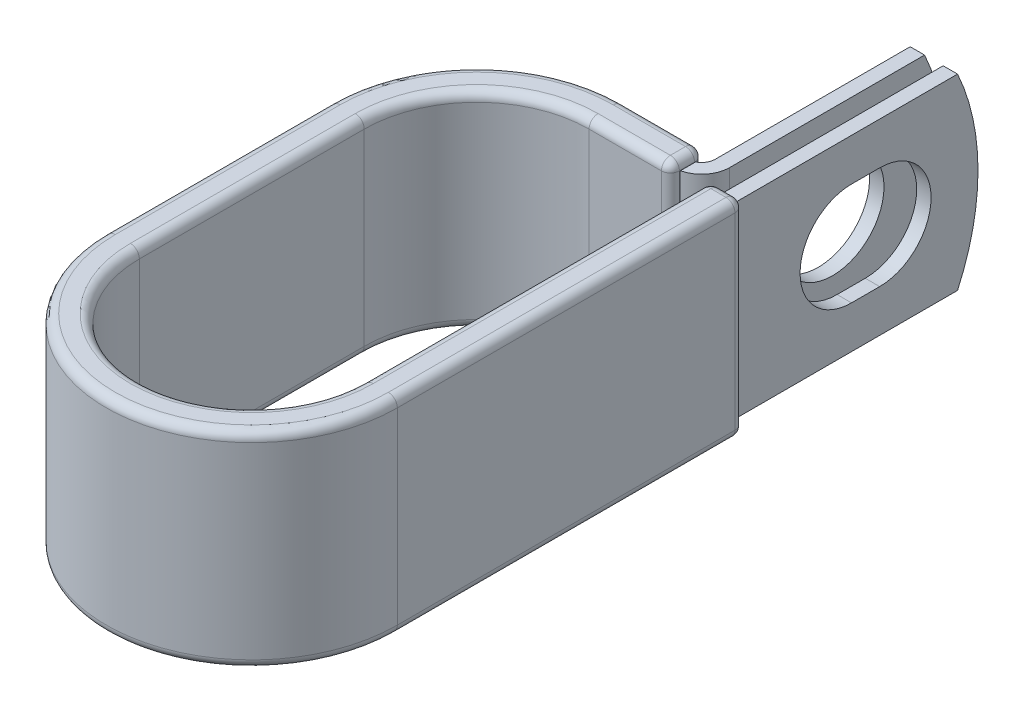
ISO-10303-21;
HEADER;
FILE_DESCRIPTION(('STEP AP214'),'2;1');
FILE_NAME('part.step','',(''),(''),'','','');
FILE_SCHEMA(('AUTOMOTIVE_DESIGN { 1 0 10303 214 1 1 1 1 }'));
ENDSEC;
DATA;
#1=APPLICATION_CONTEXT('core data for automotive mechanical design processes');
#2=APPLICATION_PROTOCOL_DEFINITION('international standard','automotive_design',2000,#1);
#3=PRODUCT_CONTEXT('',#1,'mechanical');
#4=PRODUCT('Part','Part','',(#3));
#5=PRODUCT_RELATED_PRODUCT_CATEGORY('part','',(#4));
#6=PRODUCT_DEFINITION_FORMATION('','',#4);
#7=PRODUCT_DEFINITION_CONTEXT('part definition',#1,'design');
#8=PRODUCT_DEFINITION('design','',#6,#7);
#9=PRODUCT_DEFINITION_SHAPE('','',#8);
#10=(LENGTH_UNIT() NAMED_UNIT(*) SI_UNIT(.MILLI.,.METRE.));
#11=(NAMED_UNIT(*) PLANE_ANGLE_UNIT() SI_UNIT($,.RADIAN.));
#12=(NAMED_UNIT(*) SI_UNIT($,.STERADIAN.) SOLID_ANGLE_UNIT());
#13=UNCERTAINTY_MEASURE_WITH_UNIT(LENGTH_MEASURE(1.E-05),#10,'distance_accuracy_value','');
#14=(GEOMETRIC_REPRESENTATION_CONTEXT(3) GLOBAL_UNCERTAINTY_ASSIGNED_CONTEXT((#13)) GLOBAL_UNIT_ASSIGNED_CONTEXT((#10,
#11,#12)) REPRESENTATION_CONTEXT('',''));
#15=CARTESIAN_POINT('',(0.,0.,0.));
#16=DIRECTION('',(0.,0.,1.));
#17=DIRECTION('',(1.,0.,0.));
#18=AXIS2_PLACEMENT_3D('',#15,#16,#17);
#19=CARTESIAN_POINT('',(8.74395,7.9375,-30.9372));
#20=DIRECTION('',(1.,0.,0.));
#21=DIRECTION('',(0.,0.,-1.));
#22=AXIS2_PLACEMENT_3D('',#19,#20,#21);
#23=PLANE('',#22);
#24=CARTESIAN_POINT('',(8.74395,0.,-21.4122));
#25=DIRECTION('',(1.,0.,0.));
#26=DIRECTION('',(0.,0.,-1.));
#27=AXIS2_PLACEMENT_3D('',#24,#25,#26);
#28=CIRCLE('',#27,4.3561);
#29=CARTESIAN_POINT('',(8.74395,0.,-25.7683));
#30=VERTEX_POINT('',#29);
#31=EDGE_CURVE('E366',#30,#30,#28,.F.);
#32=ORIENTED_EDGE('',*,*,#31,.T.);
#33=EDGE_LOOP('',(#32));
#34=FACE_BOUND('',#33,.T.);
#35=DIRECTION('',(0.,0.,1.));
#36=VECTOR('',#35,1.);
#37=CARTESIAN_POINT('',(8.74395,-7.9375,-30.9372));
#38=LINE('',#37,#36);
#39=CARTESIAN_POINT('',(8.74395,-7.9375,-29.2047804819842));
#40=VERTEX_POINT('',#39);
#41=CARTESIAN_POINT('',(8.74395,-7.9375,-12.69619));
#42=VERTEX_POINT('',#41);
#43=EDGE_CURVE('E369',#40,#42,#38,.T.);
#44=ORIENTED_EDGE('',*,*,#43,.F.);
#45=CARTESIAN_POINT('',(8.74395,0.,-11.8872));
#46=DIRECTION('',(1.,0.,0.));
#47=DIRECTION('',(0.,0.,-1.));
#48=AXIS2_PLACEMENT_3D('',#45,#46,#47);
#49=CIRCLE('',#48,19.05);
#50=CARTESIAN_POINT('',(8.74395,7.9375,-29.2047804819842));
#51=VERTEX_POINT('',#50);
#52=EDGE_CURVE('E741',#40,#51,#49,.T.);
#53=ORIENTED_EDGE('',*,*,#52,.T.);
#54=DIRECTION('',(0.,0.,1.));
#55=VECTOR('',#54,1.);
#56=CARTESIAN_POINT('',(8.74395,7.9375,-30.9372));
#57=LINE('',#56,#55);
#58=CARTESIAN_POINT('',(8.74395,7.9375,-12.69619));
#59=VERTEX_POINT('',#58);
#60=EDGE_CURVE('E353',#51,#59,#57,.T.);
#61=ORIENTED_EDGE('',*,*,#60,.T.);
#62=DIRECTION('',(0.,-1.,0.));
#63=VECTOR('',#62,1.);
#64=CARTESIAN_POINT('',(8.74395,7.9375,-12.69619));
#65=LINE('',#64,#63);
#66=EDGE_CURVE('E376',#59,#42,#65,.T.);
#67=ORIENTED_EDGE('',*,*,#66,.T.);
#68=EDGE_LOOP('',(#44,#53,#61,#67));
#69=FACE_BOUND('',#68,.T.);
#70=ADVANCED_FACE('F37',(#34,#69),#23,.T.);
#71=CARTESIAN_POINT('',(7.52475,7.9375,-30.9372));
#72=DIRECTION('',(1.,0.,0.));
#73=DIRECTION('',(0.,0.,-1.));
#74=AXIS2_PLACEMENT_3D('',#71,#72,#73);
#75=PLANE('',#74);
#76=CARTESIAN_POINT('',(7.52475,0.,-21.4122));
#77=DIRECTION('',(-1.,0.,0.));
#78=DIRECTION('',(0.,0.,1.));
#79=AXIS2_PLACEMENT_3D('',#76,#77,#78);
#80=CIRCLE('',#79,4.3561);
#81=CARTESIAN_POINT('',(7.52475,0.,-17.0561));
#82=VERTEX_POINT('',#81);
#83=EDGE_CURVE('E778',#82,#82,#80,.T.);
#84=ORIENTED_EDGE('',*,*,#83,.F.);
#85=EDGE_LOOP('',(#84));
#86=FACE_BOUND('',#85,.T.);
#87=CARTESIAN_POINT('',(7.52475,0.,-11.8872));
#88=DIRECTION('',(-1.,0.,0.));
#89=DIRECTION('',(0.,0.,1.));
#90=AXIS2_PLACEMENT_3D('',#87,#88,#89);
#91=CIRCLE('',#90,19.05);
#92=CARTESIAN_POINT('',(7.52475,7.9375,-29.2047804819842));
#93=VERTEX_POINT('',#92);
#94=CARTESIAN_POINT('',(7.52475,-7.9375,-29.2047804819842));
#95=VERTEX_POINT('',#94);
#96=EDGE_CURVE('E735',#93,#95,#91,.T.);
#97=ORIENTED_EDGE('',*,*,#96,.T.);
#98=DIRECTION('',(0.,0.,1.));
#99=VECTOR('',#98,1.);
#100=CARTESIAN_POINT('',(7.52475,-7.9375,-30.9372));
#101=LINE('',#100,#99);
#102=CARTESIAN_POINT('',(7.52475,-7.9375,-12.69619));
#103=VERTEX_POINT('',#102);
#104=EDGE_CURVE('E371',#95,#103,#101,.T.);
#105=ORIENTED_EDGE('',*,*,#104,.T.);
#106=DIRECTION('',(0.,-1.,0.));
#107=VECTOR('',#106,1.);
#108=CARTESIAN_POINT('',(7.52475,7.9375,-12.69619));
#109=LINE('',#108,#107);
#110=CARTESIAN_POINT('',(7.52475,7.9375,-12.69619));
#111=VERTEX_POINT('',#110);
#112=EDGE_CURVE('E363',#111,#103,#109,.T.);
#113=ORIENTED_EDGE('',*,*,#112,.F.);
#114=DIRECTION('',(0.,0.,1.));
#115=VECTOR('',#114,1.);
#116=CARTESIAN_POINT('',(7.52475,7.9375,-30.9372));
#117=LINE('',#116,#115);
#118=EDGE_CURVE('E360',#93,#111,#117,.T.);
#119=ORIENTED_EDGE('',*,*,#118,.F.);
#120=EDGE_LOOP('',(#97,#105,#113,#119));
#121=FACE_BOUND('',#120,.T.);
#122=ADVANCED_FACE('F804',(#86,#121),#75,.F.);
#123=CARTESIAN_POINT('',(0.,-7.9375,19.05));
#124=DIRECTION('',(0.,1.,0.));
#125=DIRECTION('',(1.,0.,0.));
#126=AXIS2_PLACEMENT_3D('',#123,#124,#125);
#127=PLANE('',#126);
#128=CARTESIAN_POINT('',(6.36651,-7.9375,-12.69619));
#129=DIRECTION('',(0.,-1.,0.));
#130=DIRECTION('',(0.,0.,1.));
#131=AXIS2_PLACEMENT_3D('',#128,#129,#130);
#132=CIRCLE('',#131,2.37744);
#133=CARTESIAN_POINT('',(6.88975000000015,-7.9375,-10.3770434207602));
#134=VERTEX_POINT('',#133);
#135=EDGE_CURVE('E365',#42,#134,#132,.T.);
#136=ORIENTED_EDGE('',*,*,#135,.T.);
#137=DIRECTION('',(0.,0.,-1.));
#138=VECTOR('',#137,1.);
#139=CARTESIAN_POINT('',(6.88975000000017,-7.9375,-11.53795));
#140=LINE('',#139,#138);
#141=CARTESIAN_POINT('',(6.88975000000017,-7.9375,-11.5697));
#142=VERTEX_POINT('',#141);
#143=EDGE_CURVE('E690',#134,#142,#140,.T.);
#144=ORIENTED_EDGE('',*,*,#143,.T.);
#145=CARTESIAN_POINT('',(6.12775000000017,-7.9375,-11.5697));
#146=DIRECTION('',(0.,1.,0.));
#147=DIRECTION('',(0.,0.,1.));
#148=AXIS2_PLACEMENT_3D('',#145,#146,#147);
#149=CIRCLE('',#148,0.762);
#150=CARTESIAN_POINT('',(6.88436105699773,-7.9375,-11.6601638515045));
#151=VERTEX_POINT('',#150);
#152=EDGE_CURVE('E442',#142,#151,#149,.T.);
#153=ORIENTED_EDGE('',*,*,#152,.T.);
#154=CARTESIAN_POINT('',(6.36651,-7.9375,-12.69619));
#155=DIRECTION('',(0.,1.,0.));
#156=DIRECTION('',(1.,0.,0.));
#157=AXIS2_PLACEMENT_3D('',#154,#155,#156);
#158=CIRCLE('',#157,1.15824);
#159=EDGE_CURVE('E60',#103,#151,#158,.F.);
#160=ORIENTED_EDGE('',*,*,#159,.F.);
#161=ORIENTED_EDGE('',*,*,#104,.F.);
#162=DIRECTION('',(-1.,0.,0.));
#163=VECTOR('',#162,1.);
#164=CARTESIAN_POINT('',(11.53795,-7.9375,-29.2047804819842));
#165=LINE('',#164,#163);
#166=EDGE_CURVE('E385',#40,#95,#165,.T.);
#167=ORIENTED_EDGE('',*,*,#166,.F.);
#168=ORIENTED_EDGE('',*,*,#43,.T.);
#169=EDGE_LOOP('',(#136,#144,#153,#160,#161,#167,#168));
#170=FACE_BOUND('',#169,.T.);
#171=ADVANCED_FACE('F809',(#170),#127,.F.);
#172=CARTESIAN_POINT('',(0.,7.9375,19.05));
#173=DIRECTION('',(0.,1.,0.));
#174=DIRECTION('',(1.,0.,0.));
#175=AXIS2_PLACEMENT_3D('',#172,#173,#174);
#176=PLANE('',#175);
#177=DIRECTION('',(0.,0.,-1.));
#178=VECTOR('',#177,1.);
#179=CARTESIAN_POINT('',(6.88974999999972,7.9375,19.0500000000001));
#180=LINE('',#179,#178);
#181=CARTESIAN_POINT('',(6.88975000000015,7.9375,-10.3770434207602));
#182=VERTEX_POINT('',#181);
#183=CARTESIAN_POINT('',(6.88975000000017,7.9375,-11.5697));
#184=VERTEX_POINT('',#183);
#185=EDGE_CURVE('E729',#182,#184,#180,.T.);
#186=ORIENTED_EDGE('',*,*,#185,.F.);
#187=CARTESIAN_POINT('',(6.36651,7.9375,-12.69619));
#188=DIRECTION('',(0.,-1.,0.));
#189=DIRECTION('',(0.,0.,1.));
#190=AXIS2_PLACEMENT_3D('',#187,#188,#189);
#191=CIRCLE('',#190,2.37744);
#192=EDGE_CURVE('E349',#59,#182,#191,.T.);
#193=ORIENTED_EDGE('',*,*,#192,.F.);
#194=ORIENTED_EDGE('',*,*,#60,.F.);
#195=DIRECTION('',(-1.,0.,0.));
#196=VECTOR('',#195,1.);
#197=CARTESIAN_POINT('',(11.53795,7.9375,-29.2047804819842));
#198=LINE('',#197,#196);
#199=EDGE_CURVE('E382',#51,#93,#198,.T.);
#200=ORIENTED_EDGE('',*,*,#199,.T.);
#201=ORIENTED_EDGE('',*,*,#118,.T.);
#202=CARTESIAN_POINT('',(6.36651,7.9375,-12.69619));
#203=DIRECTION('',(0.,1.,0.));
#204=DIRECTION('',(1.,0.,0.));
#205=AXIS2_PLACEMENT_3D('',#202,#203,#204);
#206=CIRCLE('',#205,1.15824);
#207=CARTESIAN_POINT('',(6.88436105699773,7.9375,-11.6601638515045));
#208=VERTEX_POINT('',#207);
#209=EDGE_CURVE('E53',#111,#208,#206,.F.);
#210=ORIENTED_EDGE('',*,*,#209,.T.);
#211=CARTESIAN_POINT('',(6.12775000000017,7.9375,-11.5697));
#212=DIRECTION('',(0.,1.,0.));
#213=DIRECTION('',(0.,0.,1.));
#214=AXIS2_PLACEMENT_3D('',#211,#212,#213);
#215=CIRCLE('',#214,0.762);
#216=EDGE_CURVE('E12',#208,#184,#215,.F.);
#217=ORIENTED_EDGE('',*,*,#216,.T.);
#218=EDGE_LOOP('',(#186,#193,#194,#200,#201,#210,#217));
#219=FACE_BOUND('',#218,.T.);
#220=ADVANCED_FACE('F815',(#219),#176,.T.);
#221=CARTESIAN_POINT('',(6.36651,7.9375,-12.69619));
#222=DIRECTION('',(0.,-1.,0.));
#223=DIRECTION('',(0.,0.,-1.));
#224=AXIS2_PLACEMENT_3D('',#221,#222,#223);
#225=CYLINDRICAL_SURFACE('',#224,2.37744);
#226=ORIENTED_EDGE('',*,*,#135,.F.);
#227=ORIENTED_EDGE('',*,*,#66,.F.);
#228=ORIENTED_EDGE('',*,*,#192,.T.);
#229=CARTESIAN_POINT('',(6.36651,7.9375,-12.69619));
#230=DIRECTION('',(0.,-1.,0.));
#231=DIRECTION('',(0.,0.,-1.));
#232=AXIS2_PLACEMENT_3D('',#229,#230,#231);
#233=CIRCLE('',#232,2.37744);
#234=CARTESIAN_POINT('',(6.36651000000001,7.9375,-10.31875));
#235=VERTEX_POINT('',#234);
#236=EDGE_CURVE('E726',#235,#182,#233,.F.);
#237=ORIENTED_EDGE('',*,*,#236,.F.);
#238=DIRECTION('',(0.,-1.,0.));
#239=VECTOR('',#238,1.);
#240=CARTESIAN_POINT('',(6.36651,7.9375,-10.31875));
#241=LINE('',#240,#239);
#242=CARTESIAN_POINT('',(6.36651000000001,-7.9375,-10.31875));
#243=VERTEX_POINT('',#242);
#244=EDGE_CURVE('E379',#235,#243,#241,.T.);
#245=ORIENTED_EDGE('',*,*,#244,.T.);
#246=CARTESIAN_POINT('',(6.36651,-7.9375,-12.69619));
#247=DIRECTION('',(0.,1.,0.));
#248=DIRECTION('',(0.,0.,1.));
#249=AXIS2_PLACEMENT_3D('',#246,#247,#248);
#250=CIRCLE('',#249,2.37744);
#251=EDGE_CURVE('E724',#134,#243,#250,.F.);
#252=ORIENTED_EDGE('',*,*,#251,.F.);
#253=EDGE_LOOP('',(#226,#227,#228,#237,#245,#252));
#254=FACE_BOUND('',#253,.T.);
#255=ADVANCED_FACE('F799',(#254),#225,.T.);
#256=CARTESIAN_POINT('',(6.36651,7.9375,-12.69619));
#257=DIRECTION('',(0.,-1.,0.));
#258=DIRECTION('',(0.,0.,-1.));
#259=AXIS2_PLACEMENT_3D('',#256,#257,#258);
#260=CYLINDRICAL_SURFACE('',#259,1.15824);
#261=ORIENTED_EDGE('',*,*,#159,.T.);
#262=DIRECTION('',(0.,1.,0.));
#263=VECTOR('',#262,1.);
#264=CARTESIAN_POINT('',(6.88436105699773,-7.9375,-11.6601638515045));
#265=LINE('',#264,#263);
#266=EDGE_CURVE('E46',#151,#208,#265,.T.);
#267=ORIENTED_EDGE('',*,*,#266,.T.);
#268=ORIENTED_EDGE('',*,*,#209,.F.);
#269=ORIENTED_EDGE('',*,*,#112,.T.);
#270=EDGE_LOOP('',(#261,#267,#268,#269));
#271=FACE_BOUND('',#270,.T.);
#272=ADVANCED_FACE('F788',(#271),#260,.F.);
#273=CARTESIAN_POINT('',(21.0648613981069,0.,-21.4122));
#274=DIRECTION('',(-1.,0.,0.));
#275=DIRECTION('',(0.,0.,1.));
#276=AXIS2_PLACEMENT_3D('',#273,#274,#275);
#277=CYLINDRICAL_SURFACE('',#276,4.3561);
#278=ORIENTED_EDGE('',*,*,#83,.T.);
#279=EDGE_LOOP('',(#278));
#280=FACE_BOUND('',#279,.T.);
#281=ORIENTED_EDGE('',*,*,#31,.F.);
#282=EDGE_LOOP('',(#281));
#283=FACE_BOUND('',#282,.T.);
#284=ADVANCED_FACE('F785',(#280,#283),#277,.F.);
#285=CARTESIAN_POINT('',(11.53795,0.,-11.8872));
#286=DIRECTION('',(-1.,0.,0.));
#287=DIRECTION('',(0.,0.,1.));
#288=AXIS2_PLACEMENT_3D('',#285,#286,#287);
#289=CYLINDRICAL_SURFACE('',#288,19.05);
#290=ORIENTED_EDGE('',*,*,#52,.F.);
#291=ORIENTED_EDGE('',*,*,#166,.T.);
#292=ORIENTED_EDGE('',*,*,#96,.F.);
#293=ORIENTED_EDGE('',*,*,#199,.F.);
#294=EDGE_LOOP('',(#290,#291,#292,#293));
#295=FACE_BOUND('',#294,.T.);
#296=ADVANCED_FACE('F787',(#295),#289,.T.);
#297=CARTESIAN_POINT('',(1.47376153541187E-13,-7.9375,-10.31875));
#298=DIRECTION('',(0.,0.,1.));
#299=DIRECTION('',(1.,0.,0.));
#300=AXIS2_PLACEMENT_3D('',#297,#298,#299);
#301=PLANE('',#300);
#302=DIRECTION('',(1.,0.,0.));
#303=VECTOR('',#302,1.);
#304=CARTESIAN_POINT('',(1.47376153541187E-13,-7.9375,-10.31875));
#305=LINE('',#304,#303);
#306=CARTESIAN_POINT('',(6.88975000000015,-7.9375,-10.31875));
#307=VERTEX_POINT('',#306);
#308=EDGE_CURVE('E697',#243,#307,#305,.T.);
#309=ORIENTED_EDGE('',*,*,#308,.F.);
#310=ORIENTED_EDGE('',*,*,#244,.F.);
#311=DIRECTION('',(1.,0.,0.));
#312=VECTOR('',#311,1.);
#313=CARTESIAN_POINT('',(1.47376153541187E-13,7.9375,-10.31875));
#314=LINE('',#313,#312);
#315=CARTESIAN_POINT('',(6.88975000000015,7.9375,-10.31875));
#316=VERTEX_POINT('',#315);
#317=EDGE_CURVE('E699',#235,#316,#314,.T.);
#318=ORIENTED_EDGE('',*,*,#317,.T.);
#319=DIRECTION('',(0.,-1.,0.));
#320=VECTOR('',#319,1.);
#321=CARTESIAN_POINT('',(6.88975000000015,-7.9375,-10.31875));
#322=LINE('',#321,#320);
#323=EDGE_CURVE('E687',#316,#307,#322,.T.);
#324=ORIENTED_EDGE('',*,*,#323,.T.);
#325=EDGE_LOOP('',(#309,#310,#318,#324));
#326=FACE_BOUND('',#325,.T.);
#327=ADVANCED_FACE('F795',(#326),#301,.F.);
#328=CARTESIAN_POINT('',(6.88975000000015,-7.96925,-10.287));
#329=DIRECTION('',(1.,0.,0.));
#330=DIRECTION('',(0.,0.,-1.));
#331=AXIS2_PLACEMENT_3D('',#328,#329,#330);
#332=PLANE('',#331);
#333=DIRECTION('',(0.,0.,-1.));
#334=VECTOR('',#333,1.);
#335=CARTESIAN_POINT('',(6.88975000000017,-7.96925,-11.5697));
#336=LINE('',#335,#334);
#337=CARTESIAN_POINT('',(6.88975000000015,-7.96925,-10.287));
#338=VERTEX_POINT('',#337);
#339=CARTESIAN_POINT('',(6.88975000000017,-7.96925,-11.5697));
#340=VERTEX_POINT('',#339);
#341=EDGE_CURVE('E395',#338,#340,#336,.T.);
#342=ORIENTED_EDGE('',*,*,#341,.T.);
#343=DIRECTION('',(0.,1.,0.));
#344=VECTOR('',#343,1.);
#345=CARTESIAN_POINT('',(6.88975000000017,-7.96925,-11.5697));
#346=LINE('',#345,#344);
#347=EDGE_CURVE('E399',#340,#142,#346,.T.);
#348=ORIENTED_EDGE('',*,*,#347,.T.);
#349=ORIENTED_EDGE('',*,*,#143,.F.);
#350=EDGE_CURVE('E691',#307,#134,#140,.T.);
#351=ORIENTED_EDGE('',*,*,#350,.F.);
#352=ORIENTED_EDGE('',*,*,#323,.F.);
#353=DIRECTION('',(0.,0.,1.));
#354=VECTOR('',#353,1.);
#355=CARTESIAN_POINT('',(6.88975000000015,7.9375,-10.31875));
#356=LINE('',#355,#354);
#357=EDGE_CURVE('E694',#182,#316,#356,.T.);
#358=ORIENTED_EDGE('',*,*,#357,.F.);
#359=ORIENTED_EDGE('',*,*,#185,.T.);
#360=DIRECTION('',(0.,1.,0.));
#361=VECTOR('',#360,1.);
#362=CARTESIAN_POINT('',(6.88975000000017,-7.96925,-11.5697));
#363=LINE('',#362,#361);
#364=CARTESIAN_POINT('',(6.88975000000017,7.96925,-11.5697));
#365=VERTEX_POINT('',#364);
#366=EDGE_CURVE('E397',#184,#365,#363,.T.);
#367=ORIENTED_EDGE('',*,*,#366,.T.);
#368=DIRECTION('',(0.,0.,1.));
#369=VECTOR('',#368,1.);
#370=CARTESIAN_POINT('',(6.88975000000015,7.96925,-10.287));
#371=LINE('',#370,#369);
#372=CARTESIAN_POINT('',(6.88975000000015,7.96925,-10.287));
#373=VERTEX_POINT('',#372);
#374=EDGE_CURVE('E391',#365,#373,#371,.T.);
#375=ORIENTED_EDGE('',*,*,#374,.T.);
#376=DIRECTION('',(0.,-1.,0.));
#377=VECTOR('',#376,1.);
#378=CARTESIAN_POINT('',(6.88975000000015,-7.96925,-10.287));
#379=LINE('',#378,#377);
#380=EDGE_CURVE('E393',#373,#338,#379,.T.);
#381=ORIENTED_EDGE('',*,*,#380,.T.);
#382=EDGE_LOOP('',(#342,#348,#349,#351,#352,#358,#359,#367,#375,#381));
#383=FACE_BOUND('',#382,.T.);
#384=ADVANCED_FACE('F1241',(#383),#332,.T.);
#385=CARTESIAN_POINT('',(1.64924556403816E-13,-7.96925,-11.5697));
#386=DIRECTION('',(1.,0.,0.));
#387=DIRECTION('',(0.,0.,-1.));
#388=AXIS2_PLACEMENT_3D('',#385,#386,#387);
#389=CYLINDRICAL_SURFACE('',#388,0.762000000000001);
#390=DIRECTION('',(1.,0.,0.));
#391=VECTOR('',#390,1.);
#392=CARTESIAN_POINT('',(1.78924883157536E-13,-7.96925,-12.3317));
#393=LINE('',#392,#391);
#394=CARTESIAN_POINT('',(1.78924883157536E-13,-7.96925,-12.3317));
#395=VERTEX_POINT('',#394);
#396=CARTESIAN_POINT('',(6.12775000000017,-7.96925,-12.3317));
#397=VERTEX_POINT('',#396);
#398=EDGE_CURVE('E715',#395,#397,#393,.T.);
#399=ORIENTED_EDGE('',*,*,#398,.T.);
#400=CARTESIAN_POINT('',(6.12775000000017,-7.96925,-11.5697));
#401=DIRECTION('',(1.,0.,0.));
#402=DIRECTION('',(0.,0.,-1.));
#403=AXIS2_PLACEMENT_3D('',#400,#401,#402);
#404=CIRCLE('',#403,0.762000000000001);
#405=CARTESIAN_POINT('',(6.12775000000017,-8.73125,-11.5697));
#406=VERTEX_POINT('',#405);
#407=EDGE_CURVE('E404',#397,#406,#404,.F.);
#408=ORIENTED_EDGE('',*,*,#407,.T.);
#409=DIRECTION('',(1.,0.,0.));
#410=VECTOR('',#409,1.);
#411=CARTESIAN_POINT('',(1.64924556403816E-13,-8.73125,-11.5697));
#412=LINE('',#411,#410);
#413=CARTESIAN_POINT('',(1.64924556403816E-13,-8.73125,-11.5697));
#414=VERTEX_POINT('',#413);
#415=EDGE_CURVE('E718',#414,#406,#412,.T.);
#416=ORIENTED_EDGE('',*,*,#415,.F.);
#417=CARTESIAN_POINT('',(1.64924556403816E-13,-7.96925,-11.5697));
#418=DIRECTION('',(1.,0.,0.));
#419=DIRECTION('',(0.,0.,1.));
#420=AXIS2_PLACEMENT_3D('',#417,#418,#419);
#421=CIRCLE('',#420,0.762000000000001);
#422=EDGE_CURVE('E660',#414,#395,#421,.T.);
#423=ORIENTED_EDGE('',*,*,#422,.T.);
#424=EDGE_LOOP('',(#399,#408,#416,#423));
#425=FACE_BOUND('',#424,.T.);
#426=ADVANCED_FACE('F1233',(#425),#389,.T.);
#427=CARTESIAN_POINT('',(1.78924883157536E-13,7.96925,-12.3317));
#428=DIRECTION('',(0.,0.,-1.));
#429=DIRECTION('',(-1.,0.,0.));
#430=AXIS2_PLACEMENT_3D('',#427,#428,#429);
#431=PLANE('',#430);
#432=DIRECTION('',(1.,0.,0.));
#433=VECTOR('',#432,1.);
#434=CARTESIAN_POINT('',(1.78924883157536E-13,7.96925,-12.3317));
#435=LINE('',#434,#433);
#436=CARTESIAN_POINT('',(1.78924883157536E-13,7.96925,-12.3317));
#437=VERTEX_POINT('',#436);
#438=CARTESIAN_POINT('',(6.12775000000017,7.96925,-12.3317));
#439=VERTEX_POINT('',#438);
#440=EDGE_CURVE('E712',#437,#439,#435,.T.);
#441=ORIENTED_EDGE('',*,*,#440,.T.);
#442=DIRECTION('',(0.,1.,0.));
#443=VECTOR('',#442,1.);
#444=CARTESIAN_POINT('',(6.12775000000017,7.96925,-12.3317));
#445=LINE('',#444,#443);
#446=EDGE_CURVE('E402',#439,#397,#445,.F.);
#447=ORIENTED_EDGE('',*,*,#446,.T.);
#448=ORIENTED_EDGE('',*,*,#398,.F.);
#449=DIRECTION('',(0.,1.,0.));
#450=VECTOR('',#449,1.);
#451=CARTESIAN_POINT('',(1.78924883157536E-13,7.96925,-12.3317));
#452=LINE('',#451,#450);
#453=EDGE_CURVE('E657',#395,#437,#452,.T.);
#454=ORIENTED_EDGE('',*,*,#453,.T.);
#455=EDGE_LOOP('',(#441,#447,#448,#454));
#456=FACE_BOUND('',#455,.T.);
#457=ADVANCED_FACE('F1225',(#456),#431,.T.);
#458=CARTESIAN_POINT('',(1.64924556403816E-13,7.96925,-11.5697));
#459=DIRECTION('',(1.,0.,0.));
#460=DIRECTION('',(0.,0.,-1.));
#461=AXIS2_PLACEMENT_3D('',#458,#459,#460);
#462=CYLINDRICAL_SURFACE('',#461,0.762000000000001);
#463=DIRECTION('',(1.,0.,0.));
#464=VECTOR('',#463,1.);
#465=CARTESIAN_POINT('',(1.64924556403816E-13,8.73125,-11.5697));
#466=LINE('',#465,#464);
#467=CARTESIAN_POINT('',(1.64924556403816E-13,8.73125,-11.5697));
#468=VERTEX_POINT('',#467);
#469=CARTESIAN_POINT('',(6.12775000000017,8.73125,-11.5697));
#470=VERTEX_POINT('',#469);
#471=EDGE_CURVE('E709',#468,#470,#466,.T.);
#472=ORIENTED_EDGE('',*,*,#471,.T.);
#473=CARTESIAN_POINT('',(6.12775000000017,7.96925,-11.5697));
#474=DIRECTION('',(1.,0.,0.));
#475=DIRECTION('',(0.,0.,-1.));
#476=AXIS2_PLACEMENT_3D('',#473,#474,#475);
#477=CIRCLE('',#476,0.762000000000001);
#478=EDGE_CURVE('E388',#470,#439,#477,.F.);
#479=ORIENTED_EDGE('',*,*,#478,.T.);
#480=ORIENTED_EDGE('',*,*,#440,.F.);
#481=CARTESIAN_POINT('',(1.64924556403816E-13,7.96925,-11.5697));
#482=DIRECTION('',(1.,0.,0.));
#483=DIRECTION('',(0.,0.,1.));
#484=AXIS2_PLACEMENT_3D('',#481,#482,#483);
#485=CIRCLE('',#484,0.762000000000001);
#486=EDGE_CURVE('E654',#437,#468,#485,.T.);
#487=ORIENTED_EDGE('',*,*,#486,.T.);
#488=EDGE_LOOP('',(#472,#479,#480,#487));
#489=FACE_BOUND('',#488,.T.);
#490=ADVANCED_FACE('F1217',(#489),#462,.T.);
#491=CARTESIAN_POINT('',(1.47371047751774E-13,7.96925,-10.287));
#492=DIRECTION('',(1.,0.,0.));
#493=DIRECTION('',(0.,0.,-1.));
#494=AXIS2_PLACEMENT_3D('',#491,#492,#493);
#495=CYLINDRICAL_SURFACE('',#494,0.762000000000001);
#496=DIRECTION('',(1.,0.,0.));
#497=VECTOR('',#496,1.);
#498=CARTESIAN_POINT('',(1.36840167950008E-13,7.96925,-9.525));
#499=LINE('',#498,#497);
#500=CARTESIAN_POINT('',(1.36840167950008E-13,7.96925,-9.525));
#501=VERTEX_POINT('',#500);
#502=CARTESIAN_POINT('',(6.12775000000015,7.96925,-9.525));
#503=VERTEX_POINT('',#502);
#504=EDGE_CURVE('E704',#501,#503,#499,.T.);
#505=ORIENTED_EDGE('',*,*,#504,.T.);
#506=CARTESIAN_POINT('',(6.12775000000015,7.96925,-10.287));
#507=DIRECTION('',(1.,0.,0.));
#508=DIRECTION('',(0.,0.,-1.));
#509=AXIS2_PLACEMENT_3D('',#506,#507,#508);
#510=CIRCLE('',#509,0.762000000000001);
#511=CARTESIAN_POINT('',(6.12775000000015,8.73125,-10.287));
#512=VERTEX_POINT('',#511);
#513=EDGE_CURVE('E414',#503,#512,#510,.F.);
#514=ORIENTED_EDGE('',*,*,#513,.T.);
#515=DIRECTION('',(1.,0.,0.));
#516=VECTOR('',#515,1.);
#517=CARTESIAN_POINT('',(1.47371047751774E-13,8.73125,-10.287));
#518=LINE('',#517,#516);
#519=CARTESIAN_POINT('',(1.47371047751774E-13,8.73125,-10.287));
#520=VERTEX_POINT('',#519);
#521=EDGE_CURVE('E707',#520,#512,#518,.T.);
#522=ORIENTED_EDGE('',*,*,#521,.F.);
#523=CARTESIAN_POINT('',(1.47371047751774E-13,7.96925,-10.287));
#524=DIRECTION('',(1.,0.,0.));
#525=DIRECTION('',(0.,0.,1.));
#526=AXIS2_PLACEMENT_3D('',#523,#524,#525);
#527=CIRCLE('',#526,0.762000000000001);
#528=EDGE_CURVE('E651',#520,#501,#527,.T.);
#529=ORIENTED_EDGE('',*,*,#528,.T.);
#530=EDGE_LOOP('',(#505,#514,#522,#529));
#531=FACE_BOUND('',#530,.T.);
#532=ADVANCED_FACE('F1209',(#531),#495,.T.);
#533=CARTESIAN_POINT('',(1.36840167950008E-13,-7.96925,-9.525));
#534=DIRECTION('',(0.,0.,1.));
#535=DIRECTION('',(1.,0.,0.));
#536=AXIS2_PLACEMENT_3D('',#533,#534,#535);
#537=PLANE('',#536);
#538=DIRECTION('',(1.,0.,0.));
#539=VECTOR('',#538,1.);
#540=CARTESIAN_POINT('',(1.36840167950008E-13,-7.96925,-9.525));
#541=LINE('',#540,#539);
#542=CARTESIAN_POINT('',(1.36840167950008E-13,-7.96925,-9.525));
#543=VERTEX_POINT('',#542);
#544=CARTESIAN_POINT('',(6.12775000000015,-7.96925,-9.525));
#545=VERTEX_POINT('',#544);
#546=EDGE_CURVE('E701',#543,#545,#541,.T.);
#547=ORIENTED_EDGE('',*,*,#546,.T.);
#548=DIRECTION('',(0.,-1.,0.));
#549=VECTOR('',#548,1.);
#550=CARTESIAN_POINT('',(6.12775000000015,-7.96925,-9.525));
#551=LINE('',#550,#549);
#552=EDGE_CURVE('E412',#545,#503,#551,.F.);
#553=ORIENTED_EDGE('',*,*,#552,.T.);
#554=ORIENTED_EDGE('',*,*,#504,.F.);
#555=DIRECTION('',(0.,-1.,0.));
#556=VECTOR('',#555,1.);
#557=CARTESIAN_POINT('',(1.36840167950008E-13,-7.96925,-9.525));
#558=LINE('',#557,#556);
#559=EDGE_CURVE('E648',#501,#543,#558,.T.);
#560=ORIENTED_EDGE('',*,*,#559,.T.);
#561=EDGE_LOOP('',(#547,#553,#554,#560));
#562=FACE_BOUND('',#561,.T.);
#563=ADVANCED_FACE('F1201',(#562),#537,.T.);
#564=CARTESIAN_POINT('',(1.47371047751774E-13,-7.96925,-10.287));
#565=DIRECTION('',(1.,0.,0.));
#566=DIRECTION('',(0.,0.,-1.));
#567=AXIS2_PLACEMENT_3D('',#564,#565,#566);
#568=CYLINDRICAL_SURFACE('',#567,0.762000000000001);
#569=DIRECTION('',(1.,0.,0.));
#570=VECTOR('',#569,1.);
#571=CARTESIAN_POINT('',(1.47371047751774E-13,-8.73125,-10.287));
#572=LINE('',#571,#570);
#573=CARTESIAN_POINT('',(1.47371047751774E-13,-8.73125,-10.287));
#574=VERTEX_POINT('',#573);
#575=CARTESIAN_POINT('',(6.12775000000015,-8.73125,-10.287));
#576=VERTEX_POINT('',#575);
#577=EDGE_CURVE('E721',#574,#576,#572,.T.);
#578=ORIENTED_EDGE('',*,*,#577,.T.);
#579=CARTESIAN_POINT('',(6.12775000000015,-7.96925,-10.287));
#580=DIRECTION('',(1.,0.,0.));
#581=DIRECTION('',(0.,0.,-1.));
#582=AXIS2_PLACEMENT_3D('',#579,#580,#581);
#583=CIRCLE('',#582,0.762000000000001);
#584=EDGE_CURVE('E410',#576,#545,#583,.F.);
#585=ORIENTED_EDGE('',*,*,#584,.T.);
#586=ORIENTED_EDGE('',*,*,#546,.F.);
#587=CARTESIAN_POINT('',(1.47371047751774E-13,-7.96925,-10.287));
#588=DIRECTION('',(1.,0.,0.));
#589=DIRECTION('',(0.,0.,-1.));
#590=AXIS2_PLACEMENT_3D('',#587,#588,#589);
#591=CIRCLE('',#590,0.762000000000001);
#592=EDGE_CURVE('E645',#543,#574,#591,.T.);
#593=ORIENTED_EDGE('',*,*,#592,.T.);
#594=EDGE_LOOP('',(#578,#585,#586,#593));
#595=FACE_BOUND('',#594,.T.);
#596=ADVANCED_FACE('F1193',(#595),#568,.T.);
#597=CARTESIAN_POINT('',(0.,-7.96925,0.));
#598=DIRECTION('',(0.,-1.,0.));
#599=DIRECTION('',(0.,0.,-1.));
#600=AXIS2_PLACEMENT_3D('',#597,#598,#599);
#601=TOROIDAL_SURFACE('',#600,11.5697,0.762000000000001);
#602=CARTESIAN_POINT('',(-11.5697,-7.96925,-1.6306400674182E-13));
#603=DIRECTION('',(0.,0.,-1.));
#604=DIRECTION('',(1.,0.,0.));
#605=AXIS2_PLACEMENT_3D('',#602,#603,#604);
#606=CIRCLE('',#605,0.762000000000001);
#607=CARTESIAN_POINT('',(-11.5697,-8.73125,-1.6306400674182E-13));
#608=VERTEX_POINT('',#607);
#609=CARTESIAN_POINT('',(-12.3317,-7.96925,-1.76941794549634E-13));
#610=VERTEX_POINT('',#609);
#611=EDGE_CURVE('E618',#608,#610,#606,.T.);
#612=ORIENTED_EDGE('',*,*,#611,.T.);
#613=CARTESIAN_POINT('',(0.,-7.96925,0.));
#614=DIRECTION('',(0.,-1.,0.));
#615=DIRECTION('',(0.,0.,-1.));
#616=AXIS2_PLACEMENT_3D('',#613,#614,#615);
#617=CIRCLE('',#616,12.3317);
#618=EDGE_CURVE('E678',#610,#395,#617,.T.);
#619=ORIENTED_EDGE('',*,*,#618,.T.);
#620=ORIENTED_EDGE('',*,*,#422,.F.);
#621=CARTESIAN_POINT('',(0.,-8.73125,0.));
#622=DIRECTION('',(0.,-1.,0.));
#623=DIRECTION('',(0.,0.,-1.));
#624=AXIS2_PLACEMENT_3D('',#621,#622,#623);
#625=CIRCLE('',#624,11.5697);
#626=EDGE_CURVE('E681',#608,#414,#625,.T.);
#627=ORIENTED_EDGE('',*,*,#626,.F.);
#628=EDGE_LOOP('',(#612,#619,#620,#627));
#629=FACE_BOUND('',#628,.T.);
#630=ADVANCED_FACE('F1185',(#629),#601,.T.);
#631=CARTESIAN_POINT('',(0.,7.9375,0.));
#632=DIRECTION('',(0.,-1.,0.));
#633=DIRECTION('',(0.,0.,-1.));
#634=AXIS2_PLACEMENT_3D('',#631,#632,#633);
#635=CYLINDRICAL_SURFACE('',#634,12.3317);
#636=DIRECTION('',(0.,1.,0.));
#637=VECTOR('',#636,1.);
#638=CARTESIAN_POINT('',(-12.3317,7.96925,-1.76941794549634E-13));
#639=LINE('',#638,#637);
#640=CARTESIAN_POINT('',(-12.3317,7.96925,-1.76941794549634E-13));
#641=VERTEX_POINT('',#640);
#642=EDGE_CURVE('E615',#610,#641,#639,.T.);
#643=ORIENTED_EDGE('',*,*,#642,.T.);
#644=CARTESIAN_POINT('',(0.,7.96925,0.));
#645=DIRECTION('',(0.,-1.,0.));
#646=DIRECTION('',(0.,0.,-1.));
#647=AXIS2_PLACEMENT_3D('',#644,#645,#646);
#648=CIRCLE('',#647,12.3317);
#649=EDGE_CURVE('E675',#641,#437,#648,.T.);
#650=ORIENTED_EDGE('',*,*,#649,.T.);
#651=ORIENTED_EDGE('',*,*,#453,.F.);
#652=ORIENTED_EDGE('',*,*,#618,.F.);
#653=EDGE_LOOP('',(#643,#650,#651,#652));
#654=FACE_BOUND('',#653,.T.);
#655=ADVANCED_FACE('F1177',(#654),#635,.T.);
#656=CARTESIAN_POINT('',(0.,7.96925,0.));
#657=DIRECTION('',(0.,-1.,0.));
#658=DIRECTION('',(0.,0.,-1.));
#659=AXIS2_PLACEMENT_3D('',#656,#657,#658);
#660=TOROIDAL_SURFACE('',#659,11.5697,0.762000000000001);
#661=CARTESIAN_POINT('',(-11.5697,7.96925,-1.6306400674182E-13));
#662=DIRECTION('',(0.,0.,-1.));
#663=DIRECTION('',(1.,0.,0.));
#664=AXIS2_PLACEMENT_3D('',#661,#662,#663);
#665=CIRCLE('',#664,0.762000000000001);
#666=CARTESIAN_POINT('',(-11.5697,8.73125,-1.6306400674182E-13));
#667=VERTEX_POINT('',#666);
#668=EDGE_CURVE('E612',#641,#667,#665,.T.);
#669=ORIENTED_EDGE('',*,*,#668,.T.);
#670=CARTESIAN_POINT('',(0.,8.73125,0.));
#671=DIRECTION('',(0.,-1.,0.));
#672=DIRECTION('',(0.,0.,-1.));
#673=AXIS2_PLACEMENT_3D('',#670,#671,#672);
#674=CIRCLE('',#673,11.5697);
#675=EDGE_CURVE('E672',#667,#468,#674,.T.);
#676=ORIENTED_EDGE('',*,*,#675,.T.);
#677=ORIENTED_EDGE('',*,*,#486,.F.);
#678=ORIENTED_EDGE('',*,*,#649,.F.);
#679=EDGE_LOOP('',(#669,#676,#677,#678));
#680=FACE_BOUND('',#679,.T.);
#681=ADVANCED_FACE('F1169',(#680),#660,.T.);
#682=CARTESIAN_POINT('',(0.,7.96925,0.));
#683=DIRECTION('',(0.,-1.,0.));
#684=DIRECTION('',(0.,0.,-1.));
#685=AXIS2_PLACEMENT_3D('',#682,#683,#684);
#686=TOROIDAL_SURFACE('',#685,10.287,0.762000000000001);
#687=CARTESIAN_POINT('',(-10.287,7.96925,-1.45716771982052E-13));
#688=DIRECTION('',(0.,0.,-1.));
#689=DIRECTION('',(1.,0.,0.));
#690=AXIS2_PLACEMENT_3D('',#687,#688,#689);
#691=CIRCLE('',#690,0.762000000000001);
#692=CARTESIAN_POINT('',(-10.287,8.73125,-1.45716771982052E-13));
#693=VERTEX_POINT('',#692);
#694=CARTESIAN_POINT('',(-9.525,7.96925,-1.35308431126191E-13));
#695=VERTEX_POINT('',#694);
#696=EDGE_CURVE('E609',#693,#695,#691,.T.);
#697=ORIENTED_EDGE('',*,*,#696,.T.);
#698=CARTESIAN_POINT('',(0.,7.96925,0.));
#699=DIRECTION('',(0.,-1.,0.));
#700=DIRECTION('',(0.,0.,-1.));
#701=AXIS2_PLACEMENT_3D('',#698,#699,#700);
#702=CIRCLE('',#701,9.525);
#703=EDGE_CURVE('E666',#695,#501,#702,.T.);
#704=ORIENTED_EDGE('',*,*,#703,.T.);
#705=ORIENTED_EDGE('',*,*,#528,.F.);
#706=CARTESIAN_POINT('',(0.,8.73125,0.));
#707=DIRECTION('',(0.,-1.,0.));
#708=DIRECTION('',(0.,0.,-1.));
#709=AXIS2_PLACEMENT_3D('',#706,#707,#708);
#710=CIRCLE('',#709,10.287);
#711=EDGE_CURVE('E669',#693,#520,#710,.T.);
#712=ORIENTED_EDGE('',*,*,#711,.F.);
#713=EDGE_LOOP('',(#697,#704,#705,#712));
#714=FACE_BOUND('',#713,.T.);
#715=ADVANCED_FACE('F1161',(#714),#686,.T.);
#716=CARTESIAN_POINT('',(0.,7.9375,0.));
#717=DIRECTION('',(0.,-1.,0.));
#718=DIRECTION('',(0.,0.,-1.));
#719=AXIS2_PLACEMENT_3D('',#716,#717,#718);
#720=CYLINDRICAL_SURFACE('',#719,9.525);
#721=DIRECTION('',(0.,-1.,0.));
#722=VECTOR('',#721,1.);
#723=CARTESIAN_POINT('',(-9.525,-7.96925,-1.35308431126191E-13));
#724=LINE('',#723,#722);
#725=CARTESIAN_POINT('',(-9.525,-7.96925,-1.35308431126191E-13));
#726=VERTEX_POINT('',#725);
#727=EDGE_CURVE('E606',#695,#726,#724,.T.);
#728=ORIENTED_EDGE('',*,*,#727,.T.);
#729=CARTESIAN_POINT('',(0.,-7.96925,0.));
#730=DIRECTION('',(0.,-1.,0.));
#731=DIRECTION('',(0.,0.,-1.));
#732=AXIS2_PLACEMENT_3D('',#729,#730,#731);
#733=CIRCLE('',#732,9.525);
#734=EDGE_CURVE('E663',#726,#543,#733,.T.);
#735=ORIENTED_EDGE('',*,*,#734,.T.);
#736=ORIENTED_EDGE('',*,*,#559,.F.);
#737=ORIENTED_EDGE('',*,*,#703,.F.);
#738=EDGE_LOOP('',(#728,#735,#736,#737));
#739=FACE_BOUND('',#738,.T.);
#740=ADVANCED_FACE('F1153',(#739),#720,.F.);
#741=CARTESIAN_POINT('',(0.,-7.96925,0.));
#742=DIRECTION('',(0.,-1.,0.));
#743=DIRECTION('',(0.,0.,-1.));
#744=AXIS2_PLACEMENT_3D('',#741,#742,#743);
#745=TOROIDAL_SURFACE('',#744,10.287,0.762000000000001);
#746=CARTESIAN_POINT('',(-10.287,-7.96925,-1.45716771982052E-13));
#747=DIRECTION('',(0.,0.,-1.));
#748=DIRECTION('',(-1.,0.,0.));
#749=AXIS2_PLACEMENT_3D('',#746,#747,#748);
#750=CIRCLE('',#749,0.762000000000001);
#751=CARTESIAN_POINT('',(-10.287,-8.73125,-1.45716771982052E-13));
#752=VERTEX_POINT('',#751);
#753=EDGE_CURVE('E603',#726,#752,#750,.T.);
#754=ORIENTED_EDGE('',*,*,#753,.T.);
#755=CARTESIAN_POINT('',(0.,-8.73125,0.));
#756=DIRECTION('',(0.,-1.,0.));
#757=DIRECTION('',(0.,0.,-1.));
#758=AXIS2_PLACEMENT_3D('',#755,#756,#757);
#759=CIRCLE('',#758,10.287);
#760=EDGE_CURVE('E684',#752,#574,#759,.T.);
#761=ORIENTED_EDGE('',*,*,#760,.T.);
#762=ORIENTED_EDGE('',*,*,#592,.F.);
#763=ORIENTED_EDGE('',*,*,#734,.F.);
#764=EDGE_LOOP('',(#754,#761,#762,#763));
#765=FACE_BOUND('',#764,.T.);
#766=ADVANCED_FACE('F1145',(#765),#745,.T.);
#767=CARTESIAN_POINT('',(-11.5697,-7.96925,19.0499999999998));
#768=DIRECTION('',(0.,0.,-1.));
#769=DIRECTION('',(-1.,0.,0.));
#770=AXIS2_PLACEMENT_3D('',#767,#768,#769);
#771=CYLINDRICAL_SURFACE('',#770,0.762000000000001);
#772=CARTESIAN_POINT('',(-11.5697,-7.96925,19.0499999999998));
#773=DIRECTION('',(0.,0.,-1.));
#774=DIRECTION('',(1.,0.,0.));
#775=AXIS2_PLACEMENT_3D('',#772,#773,#774);
#776=CIRCLE('',#775,0.762000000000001);
#777=CARTESIAN_POINT('',(-11.5697,-8.73125,19.0499999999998));
#778=VERTEX_POINT('',#777);
#779=CARTESIAN_POINT('',(-12.3317,-7.96925,19.0499999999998));
#780=VERTEX_POINT('',#779);
#781=EDGE_CURVE('E578',#778,#780,#776,.T.);
#782=ORIENTED_EDGE('',*,*,#781,.T.);
#783=DIRECTION('',(0.,0.,-1.));
#784=VECTOR('',#783,1.);
#785=CARTESIAN_POINT('',(-12.3317,-7.96925,19.0499999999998));
#786=LINE('',#785,#784);
#787=EDGE_CURVE('E636',#780,#610,#786,.T.);
#788=ORIENTED_EDGE('',*,*,#787,.T.);
#789=ORIENTED_EDGE('',*,*,#611,.F.);
#790=DIRECTION('',(0.,0.,-1.));
#791=VECTOR('',#790,1.);
#792=CARTESIAN_POINT('',(-11.5697,-8.73125,19.0499999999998));
#793=LINE('',#792,#791);
#794=EDGE_CURVE('E639',#778,#608,#793,.T.);
#795=ORIENTED_EDGE('',*,*,#794,.F.);
#796=EDGE_LOOP('',(#782,#788,#789,#795));
#797=FACE_BOUND('',#796,.T.);
#798=ADVANCED_FACE('F1137',(#797),#771,.T.);
#799=CARTESIAN_POINT('',(-12.3317,7.96925,19.0499999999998));
#800=DIRECTION('',(-1.,0.,0.));
#801=DIRECTION('',(0.,-1.,0.));
#802=AXIS2_PLACEMENT_3D('',#799,#800,#801);
#803=PLANE('',#802);
#804=DIRECTION('',(0.,1.,0.));
#805=VECTOR('',#804,1.);
#806=CARTESIAN_POINT('',(-12.3317,7.96925,19.0499999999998));
#807=LINE('',#806,#805);
#808=CARTESIAN_POINT('',(-12.3317,7.96925,19.0499999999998));
#809=VERTEX_POINT('',#808);
#810=EDGE_CURVE('E575',#780,#809,#807,.T.);
#811=ORIENTED_EDGE('',*,*,#810,.T.);
#812=DIRECTION('',(0.,0.,-1.));
#813=VECTOR('',#812,1.);
#814=CARTESIAN_POINT('',(-12.3317,7.96925,19.0499999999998));
#815=LINE('',#814,#813);
#816=EDGE_CURVE('E633',#809,#641,#815,.T.);
#817=ORIENTED_EDGE('',*,*,#816,.T.);
#818=ORIENTED_EDGE('',*,*,#642,.F.);
#819=ORIENTED_EDGE('',*,*,#787,.F.);
#820=EDGE_LOOP('',(#811,#817,#818,#819));
#821=FACE_BOUND('',#820,.T.);
#822=ADVANCED_FACE('F1129',(#821),#803,.T.);
#823=CARTESIAN_POINT('',(-11.5697,7.96925,19.0499999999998));
#824=DIRECTION('',(0.,0.,-1.));
#825=DIRECTION('',(-1.,0.,0.));
#826=AXIS2_PLACEMENT_3D('',#823,#824,#825);
#827=CYLINDRICAL_SURFACE('',#826,0.762000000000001);
#828=CARTESIAN_POINT('',(-11.5697,7.96925,19.0499999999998));
#829=DIRECTION('',(0.,0.,-1.));
#830=DIRECTION('',(1.,0.,0.));
#831=AXIS2_PLACEMENT_3D('',#828,#829,#830);
#832=CIRCLE('',#831,0.762000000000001);
#833=CARTESIAN_POINT('',(-11.5697,8.73125,19.0499999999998));
#834=VERTEX_POINT('',#833);
#835=EDGE_CURVE('E572',#809,#834,#832,.T.);
#836=ORIENTED_EDGE('',*,*,#835,.T.);
#837=DIRECTION('',(0.,0.,-1.));
#838=VECTOR('',#837,1.);
#839=CARTESIAN_POINT('',(-11.5697,8.73125,19.0499999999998));
#840=LINE('',#839,#838);
#841=EDGE_CURVE('E630',#834,#667,#840,.T.);
#842=ORIENTED_EDGE('',*,*,#841,.T.);
#843=ORIENTED_EDGE('',*,*,#668,.F.);
#844=ORIENTED_EDGE('',*,*,#816,.F.);
#845=EDGE_LOOP('',(#836,#842,#843,#844));
#846=FACE_BOUND('',#845,.T.);
#847=ADVANCED_FACE('F1121',(#846),#827,.T.);
#848=CARTESIAN_POINT('',(-10.287,7.96925,19.0499999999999));
#849=DIRECTION('',(0.,0.,-1.));
#850=DIRECTION('',(-1.,0.,0.));
#851=AXIS2_PLACEMENT_3D('',#848,#849,#850);
#852=CYLINDRICAL_SURFACE('',#851,0.762000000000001);
#853=CARTESIAN_POINT('',(-10.287,7.96925,19.0499999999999));
#854=DIRECTION('',(0.,0.,-1.));
#855=DIRECTION('',(1.,0.,0.));
#856=AXIS2_PLACEMENT_3D('',#853,#854,#855);
#857=CIRCLE('',#856,0.762000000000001);
#858=CARTESIAN_POINT('',(-10.287,8.73125,19.0499999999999));
#859=VERTEX_POINT('',#858);
#860=CARTESIAN_POINT('',(-9.525,7.96925,19.0499999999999));
#861=VERTEX_POINT('',#860);
#862=EDGE_CURVE('E569',#859,#861,#857,.T.);
#863=ORIENTED_EDGE('',*,*,#862,.T.);
#864=DIRECTION('',(0.,0.,-1.));
#865=VECTOR('',#864,1.);
#866=CARTESIAN_POINT('',(-9.525,7.96925,19.0499999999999));
#867=LINE('',#866,#865);
#868=EDGE_CURVE('E624',#861,#695,#867,.T.);
#869=ORIENTED_EDGE('',*,*,#868,.T.);
#870=ORIENTED_EDGE('',*,*,#696,.F.);
#871=DIRECTION('',(0.,0.,-1.));
#872=VECTOR('',#871,1.);
#873=CARTESIAN_POINT('',(-10.287,8.73125,19.0499999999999));
#874=LINE('',#873,#872);
#875=EDGE_CURVE('E627',#859,#693,#874,.T.);
#876=ORIENTED_EDGE('',*,*,#875,.F.);
#877=EDGE_LOOP('',(#863,#869,#870,#876));
#878=FACE_BOUND('',#877,.T.);
#879=ADVANCED_FACE('F1113',(#878),#852,.T.);
#880=CARTESIAN_POINT('',(-9.525,-7.96925,19.0499999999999));
#881=DIRECTION('',(1.,0.,0.));
#882=DIRECTION('',(0.,1.,0.));
#883=AXIS2_PLACEMENT_3D('',#880,#881,#882);
#884=PLANE('',#883);
#885=DIRECTION('',(0.,-1.,0.));
#886=VECTOR('',#885,1.);
#887=CARTESIAN_POINT('',(-9.525,-7.96925,19.0499999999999));
#888=LINE('',#887,#886);
#889=CARTESIAN_POINT('',(-9.525,-7.96925,19.0499999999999));
#890=VERTEX_POINT('',#889);
#891=EDGE_CURVE('E566',#861,#890,#888,.T.);
#892=ORIENTED_EDGE('',*,*,#891,.T.);
#893=DIRECTION('',(0.,0.,-1.));
#894=VECTOR('',#893,1.);
#895=CARTESIAN_POINT('',(-9.525,-7.96925,19.0499999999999));
#896=LINE('',#895,#894);
#897=EDGE_CURVE('E621',#890,#726,#896,.T.);
#898=ORIENTED_EDGE('',*,*,#897,.T.);
#899=ORIENTED_EDGE('',*,*,#727,.F.);
#900=ORIENTED_EDGE('',*,*,#868,.F.);
#901=EDGE_LOOP('',(#892,#898,#899,#900));
#902=FACE_BOUND('',#901,.T.);
#903=ADVANCED_FACE('F1105',(#902),#884,.T.);
#904=CARTESIAN_POINT('',(-10.287,-7.96925,19.0499999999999));
#905=DIRECTION('',(0.,0.,-1.));
#906=DIRECTION('',(-1.,0.,0.));
#907=AXIS2_PLACEMENT_3D('',#904,#905,#906);
#908=CYLINDRICAL_SURFACE('',#907,0.762000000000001);
#909=CARTESIAN_POINT('',(-10.287,-7.96925,19.0499999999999));
#910=DIRECTION('',(0.,0.,-1.));
#911=DIRECTION('',(-1.,0.,0.));
#912=AXIS2_PLACEMENT_3D('',#909,#910,#911);
#913=CIRCLE('',#912,0.762000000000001);
#914=CARTESIAN_POINT('',(-10.287,-8.73125,19.0499999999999));
#915=VERTEX_POINT('',#914);
#916=EDGE_CURVE('E563',#890,#915,#913,.T.);
#917=ORIENTED_EDGE('',*,*,#916,.T.);
#918=DIRECTION('',(0.,0.,-1.));
#919=VECTOR('',#918,1.);
#920=CARTESIAN_POINT('',(-10.287,-8.73125,19.0499999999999));
#921=LINE('',#920,#919);
#922=EDGE_CURVE('E642',#915,#752,#921,.T.);
#923=ORIENTED_EDGE('',*,*,#922,.T.);
#924=ORIENTED_EDGE('',*,*,#753,.F.);
#925=ORIENTED_EDGE('',*,*,#897,.F.);
#926=EDGE_LOOP('',(#917,#923,#924,#925));
#927=FACE_BOUND('',#926,.T.);
#928=ADVANCED_FACE('F1097',(#927),#908,.T.);
#929=CARTESIAN_POINT('',(0.,-7.96925,19.05));
#930=DIRECTION('',(0.,-1.,0.));
#931=DIRECTION('',(0.,0.,-1.));
#932=AXIS2_PLACEMENT_3D('',#929,#930,#931);
#933=TOROIDAL_SURFACE('',#932,11.5697,0.762000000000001);
#934=CARTESIAN_POINT('',(11.5697,-7.96925,19.05));
#935=DIRECTION('',(0.,0.,1.));
#936=DIRECTION('',(-1.,0.,0.));
#937=AXIS2_PLACEMENT_3D('',#934,#935,#936);
#938=CIRCLE('',#937,0.762000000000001);
#939=CARTESIAN_POINT('',(11.5697,-8.73125,19.05));
#940=VERTEX_POINT('',#939);
#941=CARTESIAN_POINT('',(12.3317,-7.96925,19.05));
#942=VERTEX_POINT('',#941);
#943=EDGE_CURVE('E560',#940,#942,#938,.T.);
#944=ORIENTED_EDGE('',*,*,#943,.T.);
#945=CARTESIAN_POINT('',(0.,-7.96925,19.05));
#946=DIRECTION('',(0.,-1.,0.));
#947=DIRECTION('',(0.,0.,-1.));
#948=AXIS2_PLACEMENT_3D('',#945,#946,#947);
#949=CIRCLE('',#948,12.3317);
#950=EDGE_CURVE('E594',#942,#780,#949,.T.);
#951=ORIENTED_EDGE('',*,*,#950,.T.);
#952=ORIENTED_EDGE('',*,*,#781,.F.);
#953=CARTESIAN_POINT('',(0.,-8.73125,19.05));
#954=DIRECTION('',(0.,-1.,0.));
#955=DIRECTION('',(0.,0.,-1.));
#956=AXIS2_PLACEMENT_3D('',#953,#954,#955);
#957=CIRCLE('',#956,11.5697);
#958=EDGE_CURVE('E597',#940,#778,#957,.T.);
#959=ORIENTED_EDGE('',*,*,#958,.F.);
#960=EDGE_LOOP('',(#944,#951,#952,#959));
#961=FACE_BOUND('',#960,.T.);
#962=ADVANCED_FACE('F1089',(#961),#933,.T.);
#963=CARTESIAN_POINT('',(0.,7.9375,19.05));
#964=DIRECTION('',(0.,-1.,0.));
#965=DIRECTION('',(0.,0.,-1.));
#966=AXIS2_PLACEMENT_3D('',#963,#964,#965);
#967=CYLINDRICAL_SURFACE('',#966,12.3317);
#968=DIRECTION('',(0.,1.,0.));
#969=VECTOR('',#968,1.);
#970=CARTESIAN_POINT('',(12.3317,7.96925,19.05));
#971=LINE('',#970,#969);
#972=CARTESIAN_POINT('',(12.3317,7.96925,19.05));
#973=VERTEX_POINT('',#972);
#974=EDGE_CURVE('E557',#942,#973,#971,.T.);
#975=ORIENTED_EDGE('',*,*,#974,.T.);
#976=CARTESIAN_POINT('',(0.,7.96925,19.05));
#977=DIRECTION('',(0.,-1.,0.));
#978=DIRECTION('',(0.,0.,-1.));
#979=AXIS2_PLACEMENT_3D('',#976,#977,#978);
#980=CIRCLE('',#979,12.3317);
#981=EDGE_CURVE('E591',#973,#809,#980,.T.);
#982=ORIENTED_EDGE('',*,*,#981,.T.);
#983=ORIENTED_EDGE('',*,*,#810,.F.);
#984=ORIENTED_EDGE('',*,*,#950,.F.);
#985=EDGE_LOOP('',(#975,#982,#983,#984));
#986=FACE_BOUND('',#985,.T.);
#987=ADVANCED_FACE('F1081',(#986),#967,.T.);
#988=CARTESIAN_POINT('',(0.,7.96925,19.05));
#989=DIRECTION('',(0.,-1.,0.));
#990=DIRECTION('',(0.,0.,-1.));
#991=AXIS2_PLACEMENT_3D('',#988,#989,#990);
#992=TOROIDAL_SURFACE('',#991,11.5697,0.762000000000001);
#993=CARTESIAN_POINT('',(11.5697,7.96925,19.05));
#994=DIRECTION('',(0.,0.,1.));
#995=DIRECTION('',(-1.,0.,0.));
#996=AXIS2_PLACEMENT_3D('',#993,#994,#995);
#997=CIRCLE('',#996,0.762000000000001);
#998=CARTESIAN_POINT('',(11.5697,8.73125,19.05));
#999=VERTEX_POINT('',#998);
#1000=EDGE_CURVE('E555',#973,#999,#997,.T.);
#1001=ORIENTED_EDGE('',*,*,#1000,.T.);
#1002=CARTESIAN_POINT('',(0.,8.73125,19.05));
#1003=DIRECTION('',(0.,-1.,0.));
#1004=DIRECTION('',(0.,0.,-1.));
#1005=AXIS2_PLACEMENT_3D('',#1002,#1003,#1004);
#1006=CIRCLE('',#1005,11.5697);
#1007=EDGE_CURVE('E528',#999,#834,#1006,.T.);
#1008=ORIENTED_EDGE('',*,*,#1007,.T.);
#1009=ORIENTED_EDGE('',*,*,#835,.F.);
#1010=ORIENTED_EDGE('',*,*,#981,.F.);
#1011=EDGE_LOOP('',(#1001,#1008,#1009,#1010));
#1012=FACE_BOUND('',#1011,.T.);
#1013=ADVANCED_FACE('F1073',(#1012),#992,.T.);
#1014=CARTESIAN_POINT('',(0.,7.96925,19.05));
#1015=DIRECTION('',(0.,-1.,0.));
#1016=DIRECTION('',(0.,0.,-1.));
#1017=AXIS2_PLACEMENT_3D('',#1014,#1015,#1016);
#1018=TOROIDAL_SURFACE('',#1017,10.287,0.762000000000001);
#1019=CARTESIAN_POINT('',(10.287,7.96925,19.05));
#1020=DIRECTION('',(0.,0.,1.));
#1021=DIRECTION('',(-1.,0.,0.));
#1022=AXIS2_PLACEMENT_3D('',#1019,#1020,#1021);
#1023=CIRCLE('',#1022,0.762000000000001);
#1024=CARTESIAN_POINT('',(10.287,8.73125,19.05));
#1025=VERTEX_POINT('',#1024);
#1026=CARTESIAN_POINT('',(9.525,7.96925,19.05));
#1027=VERTEX_POINT('',#1026);
#1028=EDGE_CURVE('E552',#1025,#1027,#1023,.T.);
#1029=ORIENTED_EDGE('',*,*,#1028,.T.);
#1030=CARTESIAN_POINT('',(0.,7.96925,19.05));
#1031=DIRECTION('',(0.,-1.,0.));
#1032=DIRECTION('',(0.,0.,-1.));
#1033=AXIS2_PLACEMENT_3D('',#1030,#1031,#1032);
#1034=CIRCLE('',#1033,9.525);
#1035=EDGE_CURVE('E584',#1027,#861,#1034,.T.);
#1036=ORIENTED_EDGE('',*,*,#1035,.T.);
#1037=ORIENTED_EDGE('',*,*,#862,.F.);
#1038=CARTESIAN_POINT('',(0.,8.73125,19.05));
#1039=DIRECTION('',(0.,-1.,0.));
#1040=DIRECTION('',(0.,0.,-1.));
#1041=AXIS2_PLACEMENT_3D('',#1038,#1039,#1040);
#1042=CIRCLE('',#1041,10.287);
#1043=EDGE_CURVE('E587',#1025,#859,#1042,.T.);
#1044=ORIENTED_EDGE('',*,*,#1043,.F.);
#1045=EDGE_LOOP('',(#1029,#1036,#1037,#1044));
#1046=FACE_BOUND('',#1045,.T.);
#1047=ADVANCED_FACE('F1065',(#1046),#1018,.T.);
#1048=CARTESIAN_POINT('',(0.,7.9375,19.05));
#1049=DIRECTION('',(0.,-1.,0.));
#1050=DIRECTION('',(0.,0.,-1.));
#1051=AXIS2_PLACEMENT_3D('',#1048,#1049,#1050);
#1052=CYLINDRICAL_SURFACE('',#1051,9.525);
#1053=DIRECTION('',(0.,-1.,0.));
#1054=VECTOR('',#1053,1.);
#1055=CARTESIAN_POINT('',(9.525,-7.96925,19.05));
#1056=LINE('',#1055,#1054);
#1057=CARTESIAN_POINT('',(9.525,-7.96925,19.05));
#1058=VERTEX_POINT('',#1057);
#1059=EDGE_CURVE('E549',#1027,#1058,#1056,.T.);
#1060=ORIENTED_EDGE('',*,*,#1059,.T.);
#1061=CARTESIAN_POINT('',(0.,-7.96925,19.05));
#1062=DIRECTION('',(0.,-1.,0.));
#1063=DIRECTION('',(0.,0.,-1.));
#1064=AXIS2_PLACEMENT_3D('',#1061,#1062,#1063);
#1065=CIRCLE('',#1064,9.525);
#1066=EDGE_CURVE('E581',#1058,#890,#1065,.T.);
#1067=ORIENTED_EDGE('',*,*,#1066,.T.);
#1068=ORIENTED_EDGE('',*,*,#891,.F.);
#1069=ORIENTED_EDGE('',*,*,#1035,.F.);
#1070=EDGE_LOOP('',(#1060,#1067,#1068,#1069));
#1071=FACE_BOUND('',#1070,.T.);
#1072=ADVANCED_FACE('F1057',(#1071),#1052,.F.);
#1073=CARTESIAN_POINT('',(0.,-7.96925,19.05));
#1074=DIRECTION('',(0.,-1.,0.));
#1075=DIRECTION('',(0.,0.,-1.));
#1076=AXIS2_PLACEMENT_3D('',#1073,#1074,#1075);
#1077=TOROIDAL_SURFACE('',#1076,10.287,0.762000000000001);
#1078=CARTESIAN_POINT('',(10.287,-7.96925,19.05));
#1079=DIRECTION('',(0.,0.,1.));
#1080=DIRECTION('',(1.,0.,0.));
#1081=AXIS2_PLACEMENT_3D('',#1078,#1079,#1080);
#1082=CIRCLE('',#1081,0.762000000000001);
#1083=CARTESIAN_POINT('',(10.287,-8.73125,19.05));
#1084=VERTEX_POINT('',#1083);
#1085=EDGE_CURVE('E546',#1058,#1084,#1082,.T.);
#1086=ORIENTED_EDGE('',*,*,#1085,.T.);
#1087=CARTESIAN_POINT('',(0.,-8.73125,19.05));
#1088=DIRECTION('',(0.,-1.,0.));
#1089=DIRECTION('',(0.,0.,-1.));
#1090=AXIS2_PLACEMENT_3D('',#1087,#1088,#1089);
#1091=CIRCLE('',#1090,10.287);
#1092=EDGE_CURVE('E600',#1084,#915,#1091,.T.);
#1093=ORIENTED_EDGE('',*,*,#1092,.T.);
#1094=ORIENTED_EDGE('',*,*,#916,.F.);
#1095=ORIENTED_EDGE('',*,*,#1066,.F.);
#1096=EDGE_LOOP('',(#1086,#1093,#1094,#1095));
#1097=FACE_BOUND('',#1096,.T.);
#1098=ADVANCED_FACE('F1049',(#1097),#1077,.T.);
#1099=CARTESIAN_POINT('',(10.287,-7.96925,0.));
#1100=DIRECTION('',(0.,0.,-1.));
#1101=DIRECTION('',(-1.,0.,0.));
#1102=AXIS2_PLACEMENT_3D('',#1099,#1100,#1101);
#1103=CYLINDRICAL_SURFACE('',#1102,0.762000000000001);
#1104=DIRECTION('',(0.,0.,-1.));
#1105=VECTOR('',#1104,1.);
#1106=CARTESIAN_POINT('',(9.525,-7.96925,0.));
#1107=LINE('',#1106,#1105);
#1108=CARTESIAN_POINT('',(9.525,-7.96925,-9.55675));
#1109=VERTEX_POINT('',#1108);
#1110=EDGE_CURVE('E1745',#1058,#1109,#1107,.T.);
#1111=ORIENTED_EDGE('',*,*,#1110,.T.);
#1112=CARTESIAN_POINT('',(10.287,-7.96925,-9.55675));
#1113=DIRECTION('',(0.,0.,-1.));
#1114=DIRECTION('',(-1.,0.,0.));
#1115=AXIS2_PLACEMENT_3D('',#1112,#1113,#1114);
#1116=CIRCLE('',#1115,0.762000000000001);
#1117=CARTESIAN_POINT('',(10.287,-8.73125,-9.55675));
#1118=VERTEX_POINT('',#1117);
#1119=EDGE_CURVE('E432',#1109,#1118,#1116,.F.);
#1120=ORIENTED_EDGE('',*,*,#1119,.T.);
#1121=DIRECTION('',(0.,0.,-1.));
#1122=VECTOR('',#1121,1.);
#1123=CARTESIAN_POINT('',(10.287,-8.73125,0.));
#1124=LINE('',#1123,#1122);
#1125=EDGE_CURVE('E543',#1084,#1118,#1124,.T.);
#1126=ORIENTED_EDGE('',*,*,#1125,.F.);
#1127=ORIENTED_EDGE('',*,*,#1085,.F.);
#1128=EDGE_LOOP('',(#1111,#1120,#1126,#1127));
#1129=FACE_BOUND('',#1128,.T.);
#1130=ADVANCED_FACE('F1041',(#1129),#1103,.T.);
#1131=CARTESIAN_POINT('',(11.5697,-8.73125,0.));
#1132=DIRECTION('',(0.,1.,0.));
#1133=DIRECTION('',(0.,0.,1.));
#1134=AXIS2_PLACEMENT_3D('',#1131,#1132,#1133);
#1135=PLANE('',#1134);
#1136=ORIENTED_EDGE('',*,*,#415,.T.);
#1137=DIRECTION('',(0.,0.,-1.));
#1138=VECTOR('',#1137,1.);
#1139=CARTESIAN_POINT('',(6.12775000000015,-8.73125,-10.287));
#1140=LINE('',#1139,#1138);
#1141=EDGE_CURVE('E408',#406,#576,#1140,.F.);
#1142=ORIENTED_EDGE('',*,*,#1141,.T.);
#1143=ORIENTED_EDGE('',*,*,#577,.F.);
#1144=ORIENTED_EDGE('',*,*,#760,.F.);
#1145=ORIENTED_EDGE('',*,*,#922,.F.);
#1146=ORIENTED_EDGE('',*,*,#1092,.F.);
#1147=ORIENTED_EDGE('',*,*,#1125,.T.);
#1148=DIRECTION('',(1.,0.,0.));
#1149=VECTOR('',#1148,1.);
#1150=CARTESIAN_POINT('',(11.5697,-8.73125,-9.55675));
#1151=LINE('',#1150,#1149);
#1152=CARTESIAN_POINT('',(11.5697,-8.73125,-9.55675));
#1153=VERTEX_POINT('',#1152);
#1154=EDGE_CURVE('E406',#1118,#1153,#1151,.T.);
#1155=ORIENTED_EDGE('',*,*,#1154,.T.);
#1156=DIRECTION('',(0.,0.,-1.));
#1157=VECTOR('',#1156,1.);
#1158=CARTESIAN_POINT('',(11.5697,-8.73125,0.));
#1159=LINE('',#1158,#1157);
#1160=EDGE_CURVE('E540',#940,#1153,#1159,.T.);
#1161=ORIENTED_EDGE('',*,*,#1160,.F.);
#1162=ORIENTED_EDGE('',*,*,#958,.T.);
#1163=ORIENTED_EDGE('',*,*,#794,.T.);
#1164=ORIENTED_EDGE('',*,*,#626,.T.);
#1165=EDGE_LOOP('',(#1136,#1142,#1143,#1144,#1145,#1146,#1147,#1155,#1161,#1162,#1163,#1164));
#1166=FACE_BOUND('',#1165,.T.);
#1167=ADVANCED_FACE('F1033',(#1166),#1135,.F.);
#1168=CARTESIAN_POINT('',(11.5697,-7.96925,0.));
#1169=DIRECTION('',(0.,0.,-1.));
#1170=DIRECTION('',(-1.,0.,0.));
#1171=AXIS2_PLACEMENT_3D('',#1168,#1169,#1170);
#1172=CYLINDRICAL_SURFACE('',#1171,0.762000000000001);
#1173=ORIENTED_EDGE('',*,*,#1160,.T.);
#1174=CARTESIAN_POINT('',(11.5697,-7.96925,-9.55675));
#1175=DIRECTION('',(0.,0.,-1.));
#1176=DIRECTION('',(-1.,0.,0.));
#1177=AXIS2_PLACEMENT_3D('',#1174,#1175,#1176);
#1178=CIRCLE('',#1177,0.762000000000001);
#1179=CARTESIAN_POINT('',(12.3317,-7.96925,-9.55675));
#1180=VERTEX_POINT('',#1179);
#1181=EDGE_CURVE('E430',#1153,#1180,#1178,.F.);
#1182=ORIENTED_EDGE('',*,*,#1181,.T.);
#1183=DIRECTION('',(0.,0.,-1.));
#1184=VECTOR('',#1183,1.);
#1185=CARTESIAN_POINT('',(12.3317,-7.96925,0.));
#1186=LINE('',#1185,#1184);
#1187=EDGE_CURVE('E532',#942,#1180,#1186,.T.);
#1188=ORIENTED_EDGE('',*,*,#1187,.F.);
#1189=ORIENTED_EDGE('',*,*,#943,.F.);
#1190=EDGE_LOOP('',(#1173,#1182,#1188,#1189));
#1191=FACE_BOUND('',#1190,.T.);
#1192=ADVANCED_FACE('F1025',(#1191),#1172,.T.);
#1193=CARTESIAN_POINT('',(12.3317,7.96925,0.));
#1194=DIRECTION('',(-1.,0.,0.));
#1195=DIRECTION('',(0.,-1.,0.));
#1196=AXIS2_PLACEMENT_3D('',#1193,#1194,#1195);
#1197=PLANE('',#1196);
#1198=ORIENTED_EDGE('',*,*,#1187,.T.);
#1199=DIRECTION('',(0.,1.,0.));
#1200=VECTOR('',#1199,1.);
#1201=CARTESIAN_POINT('',(12.3317,7.96925,-9.55675));
#1202=LINE('',#1201,#1200);
#1203=CARTESIAN_POINT('',(12.3317,7.96925,-9.55675));
#1204=VERTEX_POINT('',#1203);
#1205=EDGE_CURVE('E419',#1180,#1204,#1202,.T.);
#1206=ORIENTED_EDGE('',*,*,#1205,.T.);
#1207=DIRECTION('',(0.,0.,-1.));
#1208=VECTOR('',#1207,1.);
#1209=CARTESIAN_POINT('',(12.3317,7.96925,0.));
#1210=LINE('',#1209,#1208);
#1211=EDGE_CURVE('E524',#973,#1204,#1210,.T.);
#1212=ORIENTED_EDGE('',*,*,#1211,.F.);
#1213=ORIENTED_EDGE('',*,*,#974,.F.);
#1214=EDGE_LOOP('',(#1198,#1206,#1212,#1213));
#1215=FACE_BOUND('',#1214,.T.);
#1216=ADVANCED_FACE('F1018',(#1215),#1197,.F.);
#1217=CARTESIAN_POINT('',(11.5697,7.96925,0.));
#1218=DIRECTION('',(0.,0.,-1.));
#1219=DIRECTION('',(-1.,0.,0.));
#1220=AXIS2_PLACEMENT_3D('',#1217,#1218,#1219);
#1221=CYLINDRICAL_SURFACE('',#1220,0.762000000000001);
#1222=ORIENTED_EDGE('',*,*,#1211,.T.);
#1223=CARTESIAN_POINT('',(11.5697,7.96925,-9.55675));
#1224=DIRECTION('',(0.,0.,-1.));
#1225=DIRECTION('',(-1.,0.,0.));
#1226=AXIS2_PLACEMENT_3D('',#1223,#1224,#1225);
#1227=CIRCLE('',#1226,0.762000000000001);
#1228=CARTESIAN_POINT('',(11.5697,8.73125,-9.55675));
#1229=VERTEX_POINT('',#1228);
#1230=EDGE_CURVE('E416',#1204,#1229,#1227,.F.);
#1231=ORIENTED_EDGE('',*,*,#1230,.T.);
#1232=DIRECTION('',(0.,0.,-1.));
#1233=VECTOR('',#1232,1.);
#1234=CARTESIAN_POINT('',(11.5697,8.73125,0.));
#1235=LINE('',#1234,#1233);
#1236=EDGE_CURVE('E522',#999,#1229,#1235,.T.);
#1237=ORIENTED_EDGE('',*,*,#1236,.F.);
#1238=ORIENTED_EDGE('',*,*,#1000,.F.);
#1239=EDGE_LOOP('',(#1222,#1231,#1237,#1238));
#1240=FACE_BOUND('',#1239,.T.);
#1241=ADVANCED_FACE('F520',(#1240),#1221,.T.);
#1242=CARTESIAN_POINT('',(10.287,8.73125,0.));
#1243=DIRECTION('',(0.,-1.,0.));
#1244=DIRECTION('',(0.,0.,-1.));
#1245=AXIS2_PLACEMENT_3D('',#1242,#1243,#1244);
#1246=PLANE('',#1245);
#1247=ORIENTED_EDGE('',*,*,#521,.T.);
#1248=DIRECTION('',(0.,0.,1.));
#1249=VECTOR('',#1248,1.);
#1250=CARTESIAN_POINT('',(6.12775000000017,8.73125,-11.5697));
#1251=LINE('',#1250,#1249);
#1252=EDGE_CURVE('E440',#512,#470,#1251,.F.);
#1253=ORIENTED_EDGE('',*,*,#1252,.T.);
#1254=ORIENTED_EDGE('',*,*,#471,.F.);
#1255=ORIENTED_EDGE('',*,*,#675,.F.);
#1256=ORIENTED_EDGE('',*,*,#841,.F.);
#1257=ORIENTED_EDGE('',*,*,#1007,.F.);
#1258=ORIENTED_EDGE('',*,*,#1236,.T.);
#1259=DIRECTION('',(-1.,0.,0.));
#1260=VECTOR('',#1259,1.);
#1261=CARTESIAN_POINT('',(10.287,8.73125,-9.55675));
#1262=LINE('',#1261,#1260);
#1263=CARTESIAN_POINT('',(10.287,8.73125,-9.55675));
#1264=VERTEX_POINT('',#1263);
#1265=EDGE_CURVE('E438',#1229,#1264,#1262,.T.);
#1266=ORIENTED_EDGE('',*,*,#1265,.T.);
#1267=DIRECTION('',(0.,0.,-1.));
#1268=VECTOR('',#1267,1.);
#1269=CARTESIAN_POINT('',(10.287,8.73125,0.));
#1270=LINE('',#1269,#1268);
#1271=EDGE_CURVE('E530',#1025,#1264,#1270,.T.);
#1272=ORIENTED_EDGE('',*,*,#1271,.F.);
#1273=ORIENTED_EDGE('',*,*,#1043,.T.);
#1274=ORIENTED_EDGE('',*,*,#875,.T.);
#1275=ORIENTED_EDGE('',*,*,#711,.T.);
#1276=EDGE_LOOP('',(#1247,#1253,#1254,#1255,#1256,#1257,#1258,#1266,#1272,#1273,#1274,#1275));
#1277=FACE_BOUND('',#1276,.T.);
#1278=ADVANCED_FACE('F526',(#1277),#1246,.F.);
#1279=CARTESIAN_POINT('',(10.287,7.96925,0.));
#1280=DIRECTION('',(0.,0.,-1.));
#1281=DIRECTION('',(-1.,0.,0.));
#1282=AXIS2_PLACEMENT_3D('',#1279,#1280,#1281);
#1283=CYLINDRICAL_SURFACE('',#1282,0.762000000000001);
#1284=ORIENTED_EDGE('',*,*,#1271,.T.);
#1285=CARTESIAN_POINT('',(10.287,7.96925,-9.55675));
#1286=DIRECTION('',(0.,0.,-1.));
#1287=DIRECTION('',(-1.,0.,0.));
#1288=AXIS2_PLACEMENT_3D('',#1285,#1286,#1287);
#1289=CIRCLE('',#1288,0.762000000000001);
#1290=CARTESIAN_POINT('',(9.525,7.96925,-9.55675));
#1291=VERTEX_POINT('',#1290);
#1292=EDGE_CURVE('E436',#1264,#1291,#1289,.F.);
#1293=ORIENTED_EDGE('',*,*,#1292,.T.);
#1294=DIRECTION('',(0.,0.,-1.));
#1295=VECTOR('',#1294,1.);
#1296=CARTESIAN_POINT('',(9.525,7.96925,0.));
#1297=LINE('',#1296,#1295);
#1298=EDGE_CURVE('E534',#1027,#1291,#1297,.T.);
#1299=ORIENTED_EDGE('',*,*,#1298,.F.);
#1300=ORIENTED_EDGE('',*,*,#1028,.F.);
#1301=EDGE_LOOP('',(#1284,#1293,#1299,#1300));
#1302=FACE_BOUND('',#1301,.T.);
#1303=ADVANCED_FACE('F997',(#1302),#1283,.T.);
#1304=CARTESIAN_POINT('',(10.31875,7.9375,0.));
#1305=DIRECTION('',(0.,-1.,0.));
#1306=DIRECTION('',(0.,0.,-1.));
#1307=AXIS2_PLACEMENT_3D('',#1304,#1305,#1306);
#1308=PLANE('',#1307);
#1309=ORIENTED_EDGE('',*,*,#317,.F.);
#1310=ORIENTED_EDGE('',*,*,#236,.T.);
#1311=ORIENTED_EDGE('',*,*,#357,.T.);
#1312=EDGE_LOOP('',(#1309,#1310,#1311));
#1313=FACE_BOUND('',#1312,.T.);
#1314=ADVANCED_FACE('F989',(#1313),#1308,.T.);
#1315=CARTESIAN_POINT('',(11.53795,-7.9375,0.));
#1316=DIRECTION('',(0.,1.,0.));
#1317=DIRECTION('',(0.,0.,1.));
#1318=AXIS2_PLACEMENT_3D('',#1315,#1316,#1317);
#1319=PLANE('',#1318);
#1320=ORIENTED_EDGE('',*,*,#350,.T.);
#1321=ORIENTED_EDGE('',*,*,#251,.T.);
#1322=ORIENTED_EDGE('',*,*,#308,.T.);
#1323=EDGE_LOOP('',(#1320,#1321,#1322));
#1324=FACE_BOUND('',#1323,.T.);
#1325=ADVANCED_FACE('F981',(#1324),#1319,.T.);
#1326=CARTESIAN_POINT('',(9.525,-7.96925,0.));
#1327=DIRECTION('',(1.,0.,0.));
#1328=DIRECTION('',(0.,1.,0.));
#1329=AXIS2_PLACEMENT_3D('',#1326,#1327,#1328);
#1330=PLANE('',#1329);
#1331=ORIENTED_EDGE('',*,*,#1298,.T.);
#1332=DIRECTION('',(0.,-1.,0.));
#1333=VECTOR('',#1332,1.);
#1334=CARTESIAN_POINT('',(9.525,-7.96925,-9.55675));
#1335=LINE('',#1334,#1333);
#1336=EDGE_CURVE('E434',#1291,#1109,#1335,.T.);
#1337=ORIENTED_EDGE('',*,*,#1336,.T.);
#1338=ORIENTED_EDGE('',*,*,#1110,.F.);
#1339=ORIENTED_EDGE('',*,*,#1059,.F.);
#1340=EDGE_LOOP('',(#1331,#1337,#1338,#1339));
#1341=FACE_BOUND('',#1340,.T.);
#1342=ADVANCED_FACE('F974',(#1341),#1330,.F.);
#1343=CARTESIAN_POINT('',(10.287,-7.96925,-10.31875));
#1344=DIRECTION('',(0.,0.,1.));
#1345=DIRECTION('',(1.,0.,0.));
#1346=AXIS2_PLACEMENT_3D('',#1343,#1344,#1345);
#1347=PLANE('',#1346);
#1348=DIRECTION('',(-1.,0.,0.));
#1349=VECTOR('',#1348,1.);
#1350=CARTESIAN_POINT('',(10.287,7.96925,-10.31875));
#1351=LINE('',#1350,#1349);
#1352=CARTESIAN_POINT('',(10.287,7.96925,-10.31875));
#1353=VERTEX_POINT('',#1352);
#1354=CARTESIAN_POINT('',(11.5697,7.96925,-10.31875));
#1355=VERTEX_POINT('',#1354);
#1356=EDGE_CURVE('E421',#1353,#1355,#1351,.F.);
#1357=ORIENTED_EDGE('',*,*,#1356,.T.);
#1358=DIRECTION('',(0.,1.,0.));
#1359=VECTOR('',#1358,1.);
#1360=CARTESIAN_POINT('',(11.5697,-7.96925,-10.31875));
#1361=LINE('',#1360,#1359);
#1362=CARTESIAN_POINT('',(11.5697,-7.96925,-10.31875));
#1363=VERTEX_POINT('',#1362);
#1364=EDGE_CURVE('E427',#1355,#1363,#1361,.F.);
#1365=ORIENTED_EDGE('',*,*,#1364,.T.);
#1366=DIRECTION('',(1.,0.,0.));
#1367=VECTOR('',#1366,1.);
#1368=CARTESIAN_POINT('',(10.287,-7.96925,-10.31875));
#1369=LINE('',#1368,#1367);
#1370=CARTESIAN_POINT('',(10.287,-7.96925,-10.31875));
#1371=VERTEX_POINT('',#1370);
#1372=EDGE_CURVE('E425',#1363,#1371,#1369,.F.);
#1373=ORIENTED_EDGE('',*,*,#1372,.T.);
#1374=DIRECTION('',(0.,-1.,0.));
#1375=VECTOR('',#1374,1.);
#1376=CARTESIAN_POINT('',(10.287,-7.96925,-10.31875));
#1377=LINE('',#1376,#1375);
#1378=EDGE_CURVE('E423',#1371,#1353,#1377,.F.);
#1379=ORIENTED_EDGE('',*,*,#1378,.T.);
#1380=EDGE_LOOP('',(#1357,#1365,#1373,#1379));
#1381=FACE_BOUND('',#1380,.T.);
#1382=DIRECTION('',(0.,-1.,0.));
#1383=VECTOR('',#1382,1.);
#1384=CARTESIAN_POINT('',(10.31875,-7.9375,-10.31875));
#1385=LINE('',#1384,#1383);
#1386=CARTESIAN_POINT('',(10.31875,7.9375,-10.31875));
#1387=VERTEX_POINT('',#1386);
#1388=CARTESIAN_POINT('',(10.31875,-7.9375,-10.31875));
#1389=VERTEX_POINT('',#1388);
#1390=EDGE_CURVE('E328',#1387,#1389,#1385,.T.);
#1391=ORIENTED_EDGE('',*,*,#1390,.T.);
#1392=DIRECTION('',(1.,0.,0.));
#1393=VECTOR('',#1392,1.);
#1394=CARTESIAN_POINT('',(11.53795,-7.9375,-10.31875));
#1395=LINE('',#1394,#1393);
#1396=CARTESIAN_POINT('',(11.53795,-7.9375,-10.31875));
#1397=VERTEX_POINT('',#1396);
#1398=EDGE_CURVE('E1747',#1389,#1397,#1395,.T.);
#1399=ORIENTED_EDGE('',*,*,#1398,.T.);
#1400=DIRECTION('',(0.,1.,0.));
#1401=VECTOR('',#1400,1.);
#1402=CARTESIAN_POINT('',(11.53795,7.9375,-10.31875));
#1403=LINE('',#1402,#1401);
#1404=CARTESIAN_POINT('',(11.53795,7.9375,-10.31875));
#1405=VERTEX_POINT('',#1404);
#1406=EDGE_CURVE('E331',#1397,#1405,#1403,.T.);
#1407=ORIENTED_EDGE('',*,*,#1406,.T.);
#1408=DIRECTION('',(-1.,0.,0.));
#1409=VECTOR('',#1408,1.);
#1410=CARTESIAN_POINT('',(10.31875,7.9375,-10.31875));
#1411=LINE('',#1410,#1409);
#1412=EDGE_CURVE('E325',#1405,#1387,#1411,.T.);
#1413=ORIENTED_EDGE('',*,*,#1412,.T.);
#1414=EDGE_LOOP('',(#1391,#1399,#1407,#1413));
#1415=FACE_BOUND('',#1414,.T.);
#1416=ADVANCED_FACE('F327',(#1381,#1415),#1347,.F.);
#1417=CARTESIAN_POINT('',(-3.79181302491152,4.3561,-20.2184));
#1418=DIRECTION('',(0.,1.,0.));
#1419=DIRECTION('',(0.,0.,1.));
#1420=AXIS2_PLACEMENT_3D('',#1417,#1418,#1419);
#1421=PLANE('',#1420);
#1422=DIRECTION('',(1.,0.,0.));
#1423=VECTOR('',#1422,1.);
#1424=CARTESIAN_POINT('',(-3.79181302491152,4.3561,-22.606));
#1425=LINE('',#1424,#1423);
#1426=CARTESIAN_POINT('',(10.31875,4.3561,-22.606));
#1427=VERTEX_POINT('',#1426);
#1428=CARTESIAN_POINT('',(11.53795,4.3561,-22.606));
#1429=VERTEX_POINT('',#1428);
#1430=EDGE_CURVE('E769',#1427,#1429,#1425,.T.);
#1431=ORIENTED_EDGE('',*,*,#1430,.T.);
#1432=DIRECTION('',(0.,0.,1.));
#1433=VECTOR('',#1432,1.);
#1434=CARTESIAN_POINT('',(11.53795,4.3561,-20.2184));
#1435=LINE('',#1434,#1433);
#1436=CARTESIAN_POINT('',(11.53795,4.3561,-20.2184));
#1437=VERTEX_POINT('',#1436);
#1438=EDGE_CURVE('E747',#1429,#1437,#1435,.T.);
#1439=ORIENTED_EDGE('',*,*,#1438,.T.);
#1440=DIRECTION('',(1.,0.,0.));
#1441=VECTOR('',#1440,1.);
#1442=CARTESIAN_POINT('',(-3.79181302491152,4.3561,-20.2184));
#1443=LINE('',#1442,#1441);
#1444=CARTESIAN_POINT('',(10.31875,4.3561,-20.2184));
#1445=VERTEX_POINT('',#1444);
#1446=EDGE_CURVE('E765',#1445,#1437,#1443,.T.);
#1447=ORIENTED_EDGE('',*,*,#1446,.F.);
#1448=DIRECTION('',(0.,0.,1.));
#1449=VECTOR('',#1448,1.);
#1450=CARTESIAN_POINT('',(10.31875,4.3561,-20.2184));
#1451=LINE('',#1450,#1449);
#1452=EDGE_CURVE('E766',#1427,#1445,#1451,.T.);
#1453=ORIENTED_EDGE('',*,*,#1452,.F.);
#1454=EDGE_LOOP('',(#1431,#1439,#1447,#1453));
#1455=FACE_BOUND('',#1454,.T.);
#1456=ADVANCED_FACE('F961',(#1455),#1421,.F.);
#1457=CARTESIAN_POINT('',(-3.79181302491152,0.,-20.2184));
#1458=DIRECTION('',(1.,0.,0.));
#1459=DIRECTION('',(0.,0.,-1.));
#1460=AXIS2_PLACEMENT_3D('',#1457,#1458,#1459);
#1461=CYLINDRICAL_SURFACE('',#1460,4.3561);
#1462=ORIENTED_EDGE('',*,*,#1446,.T.);
#1463=CARTESIAN_POINT('',(11.53795,0.,-20.2184));
#1464=DIRECTION('',(1.,0.,0.));
#1465=DIRECTION('',(0.,0.,-1.));
#1466=AXIS2_PLACEMENT_3D('',#1463,#1464,#1465);
#1467=CIRCLE('',#1466,4.3561);
#1468=CARTESIAN_POINT('',(11.53795,-4.3561,-20.2184));
#1469=VERTEX_POINT('',#1468);
#1470=EDGE_CURVE('E746',#1437,#1469,#1467,.T.);
#1471=ORIENTED_EDGE('',*,*,#1470,.T.);
#1472=DIRECTION('',(1.,0.,0.));
#1473=VECTOR('',#1472,1.);
#1474=CARTESIAN_POINT('',(-3.79181302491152,-4.3561,-20.2184));
#1475=LINE('',#1474,#1473);
#1476=CARTESIAN_POINT('',(10.31875,-4.3561,-20.2184));
#1477=VERTEX_POINT('',#1476);
#1478=EDGE_CURVE('E764',#1477,#1469,#1475,.T.);
#1479=ORIENTED_EDGE('',*,*,#1478,.F.);
#1480=CARTESIAN_POINT('',(10.31875,0.,-20.2184));
#1481=DIRECTION('',(-1.,0.,0.));
#1482=DIRECTION('',(0.,0.,1.));
#1483=AXIS2_PLACEMENT_3D('',#1480,#1481,#1482);
#1484=CIRCLE('',#1483,4.3561);
#1485=EDGE_CURVE('E761',#1445,#1477,#1484,.F.);
#1486=ORIENTED_EDGE('',*,*,#1485,.F.);
#1487=EDGE_LOOP('',(#1462,#1471,#1479,#1486));
#1488=FACE_BOUND('',#1487,.T.);
#1489=ADVANCED_FACE('F954',(#1488),#1461,.F.);
#1490=CARTESIAN_POINT('',(-3.79181302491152,-4.3561,-20.2184));
#1491=DIRECTION('',(0.,-1.,0.));
#1492=DIRECTION('',(0.,0.,-1.));
#1493=AXIS2_PLACEMENT_3D('',#1490,#1491,#1492);
#1494=PLANE('',#1493);
#1495=ORIENTED_EDGE('',*,*,#1478,.T.);
#1496=DIRECTION('',(0.,0.,-1.));
#1497=VECTOR('',#1496,1.);
#1498=CARTESIAN_POINT('',(11.53795,-4.3561,-20.2184));
#1499=LINE('',#1498,#1497);
#1500=CARTESIAN_POINT('',(11.53795,-4.3561,-22.606));
#1501=VERTEX_POINT('',#1500);
#1502=EDGE_CURVE('E753',#1469,#1501,#1499,.T.);
#1503=ORIENTED_EDGE('',*,*,#1502,.T.);
#1504=DIRECTION('',(1.,0.,0.));
#1505=VECTOR('',#1504,1.);
#1506=CARTESIAN_POINT('',(-3.79181302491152,-4.3561,-22.606));
#1507=LINE('',#1506,#1505);
#1508=CARTESIAN_POINT('',(10.31875,-4.3561,-22.606));
#1509=VERTEX_POINT('',#1508);
#1510=EDGE_CURVE('E760',#1509,#1501,#1507,.T.);
#1511=ORIENTED_EDGE('',*,*,#1510,.F.);
#1512=DIRECTION('',(0.,0.,-1.));
#1513=VECTOR('',#1512,1.);
#1514=CARTESIAN_POINT('',(10.31875,-4.3561,-20.2184));
#1515=LINE('',#1514,#1513);
#1516=EDGE_CURVE('E749',#1477,#1509,#1515,.T.);
#1517=ORIENTED_EDGE('',*,*,#1516,.F.);
#1518=EDGE_LOOP('',(#1495,#1503,#1511,#1517));
#1519=FACE_BOUND('',#1518,.T.);
#1520=ADVANCED_FACE('F945',(#1519),#1494,.F.);
#1521=CARTESIAN_POINT('',(-3.79181302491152,0.,-22.606));
#1522=DIRECTION('',(1.,0.,0.));
#1523=DIRECTION('',(0.,0.,-1.));
#1524=AXIS2_PLACEMENT_3D('',#1521,#1522,#1523);
#1525=CYLINDRICAL_SURFACE('',#1524,4.3561);
#1526=ORIENTED_EDGE('',*,*,#1510,.T.);
#1527=CARTESIAN_POINT('',(11.53795,0.,-22.606));
#1528=DIRECTION('',(1.,0.,0.));
#1529=DIRECTION('',(0.,0.,-1.));
#1530=AXIS2_PLACEMENT_3D('',#1527,#1528,#1529);
#1531=CIRCLE('',#1530,4.3561);
#1532=EDGE_CURVE('E750',#1501,#1429,#1531,.T.);
#1533=ORIENTED_EDGE('',*,*,#1532,.T.);
#1534=ORIENTED_EDGE('',*,*,#1430,.F.);
#1535=CARTESIAN_POINT('',(10.31875,0.,-22.606));
#1536=DIRECTION('',(-1.,0.,0.));
#1537=DIRECTION('',(0.,0.,1.));
#1538=AXIS2_PLACEMENT_3D('',#1535,#1536,#1537);
#1539=CIRCLE('',#1538,4.3561);
#1540=EDGE_CURVE('E770',#1509,#1427,#1539,.F.);
#1541=ORIENTED_EDGE('',*,*,#1540,.F.);
#1542=EDGE_LOOP('',(#1526,#1533,#1534,#1541));
#1543=FACE_BOUND('',#1542,.T.);
#1544=ADVANCED_FACE('F936',(#1543),#1525,.F.);
#1545=DIRECTION('',(-1.,0.,0.));
#1546=VECTOR('',#1545,1.);
#1547=CARTESIAN_POINT('',(11.53795,7.9375,-29.2047804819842));
#1548=LINE('',#1547,#1546);
#1549=CARTESIAN_POINT('',(11.53795,7.9375,-29.2047804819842));
#1550=VERTEX_POINT('',#1549);
#1551=CARTESIAN_POINT('',(10.31875,7.9375,-29.2047804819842));
#1552=VERTEX_POINT('',#1551);
#1553=EDGE_CURVE('E348',#1550,#1552,#1548,.T.);
#1554=ORIENTED_EDGE('',*,*,#1553,.F.);
#1555=CARTESIAN_POINT('',(11.53795,0.,-11.8872));
#1556=DIRECTION('',(-1.,0.,0.));
#1557=DIRECTION('',(0.,0.,1.));
#1558=AXIS2_PLACEMENT_3D('',#1555,#1556,#1557);
#1559=CIRCLE('',#1558,19.05);
#1560=CARTESIAN_POINT('',(11.53795,-7.9375,-29.2047804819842));
#1561=VERTEX_POINT('',#1560);
#1562=EDGE_CURVE('E736',#1550,#1561,#1559,.T.);
#1563=ORIENTED_EDGE('',*,*,#1562,.T.);
#1564=DIRECTION('',(-1.,0.,0.));
#1565=VECTOR('',#1564,1.);
#1566=CARTESIAN_POINT('',(11.53795,-7.9375,-29.2047804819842));
#1567=LINE('',#1566,#1565);
#1568=CARTESIAN_POINT('',(10.31875,-7.9375,-29.2047804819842));
#1569=VERTEX_POINT('',#1568);
#1570=EDGE_CURVE('E732',#1561,#1569,#1567,.T.);
#1571=ORIENTED_EDGE('',*,*,#1570,.T.);
#1572=CARTESIAN_POINT('',(10.31875,0.,-11.8872));
#1573=DIRECTION('',(-1.,0.,0.));
#1574=DIRECTION('',(0.,0.,1.));
#1575=AXIS2_PLACEMENT_3D('',#1572,#1573,#1574);
#1576=CIRCLE('',#1575,19.05);
#1577=EDGE_CURVE('E744',#1552,#1569,#1576,.T.);
#1578=ORIENTED_EDGE('',*,*,#1577,.F.);
#1579=EDGE_LOOP('',(#1554,#1563,#1571,#1578));
#1580=FACE_BOUND('',#1579,.T.);
#1581=ADVANCED_FACE('F798',(#1580),#289,.T.);
#1582=DIRECTION('',(0.,0.,-1.));
#1583=VECTOR('',#1582,1.);
#1584=CARTESIAN_POINT('',(10.31875,7.9375,-10.31875));
#1585=LINE('',#1584,#1583);
#1586=EDGE_CURVE('E340',#1387,#1552,#1585,.T.);
#1587=ORIENTED_EDGE('',*,*,#1586,.F.);
#1588=ORIENTED_EDGE('',*,*,#1412,.F.);
#1589=DIRECTION('',(0.,0.,-1.));
#1590=VECTOR('',#1589,1.);
#1591=CARTESIAN_POINT('',(11.53795,7.9375,-10.31875));
#1592=LINE('',#1591,#1590);
#1593=EDGE_CURVE('E350',#1405,#1550,#1592,.T.);
#1594=ORIENTED_EDGE('',*,*,#1593,.T.);
#1595=ORIENTED_EDGE('',*,*,#1553,.T.);
#1596=EDGE_LOOP('',(#1587,#1588,#1594,#1595));
#1597=FACE_BOUND('',#1596,.T.);
#1598=ADVANCED_FACE('F346',(#1597),#176,.T.);
#1599=ORIENTED_EDGE('',*,*,#1398,.F.);
#1600=DIRECTION('',(0.,0.,-1.));
#1601=VECTOR('',#1600,1.);
#1602=CARTESIAN_POINT('',(10.31875,-7.9375,0.));
#1603=LINE('',#1602,#1601);
#1604=EDGE_CURVE('E342',#1389,#1569,#1603,.T.);
#1605=ORIENTED_EDGE('',*,*,#1604,.T.);
#1606=ORIENTED_EDGE('',*,*,#1570,.F.);
#1607=DIRECTION('',(0.,0.,-1.));
#1608=VECTOR('',#1607,1.);
#1609=CARTESIAN_POINT('',(11.53795,-7.9375,0.));
#1610=LINE('',#1609,#1608);
#1611=EDGE_CURVE('E355',#1397,#1561,#1610,.T.);
#1612=ORIENTED_EDGE('',*,*,#1611,.F.);
#1613=EDGE_LOOP('',(#1599,#1605,#1606,#1612));
#1614=FACE_BOUND('',#1613,.T.);
#1615=ADVANCED_FACE('F916',(#1614),#127,.F.);
#1616=CARTESIAN_POINT('',(11.53795,7.9375,0.));
#1617=DIRECTION('',(-1.,0.,0.));
#1618=DIRECTION('',(0.,0.,1.));
#1619=AXIS2_PLACEMENT_3D('',#1616,#1617,#1618);
#1620=PLANE('',#1619);
#1621=ORIENTED_EDGE('',*,*,#1532,.F.);
#1622=ORIENTED_EDGE('',*,*,#1502,.F.);
#1623=ORIENTED_EDGE('',*,*,#1470,.F.);
#1624=ORIENTED_EDGE('',*,*,#1438,.F.);
#1625=EDGE_LOOP('',(#1621,#1622,#1623,#1624));
#1626=FACE_BOUND('',#1625,.T.);
#1627=ORIENTED_EDGE('',*,*,#1406,.F.);
#1628=ORIENTED_EDGE('',*,*,#1611,.T.);
#1629=ORIENTED_EDGE('',*,*,#1562,.F.);
#1630=ORIENTED_EDGE('',*,*,#1593,.F.);
#1631=EDGE_LOOP('',(#1627,#1628,#1629,#1630));
#1632=FACE_BOUND('',#1631,.T.);
#1633=ADVANCED_FACE('F820',(#1626,#1632),#1620,.F.);
#1634=CARTESIAN_POINT('',(10.31875,7.9375,0.));
#1635=DIRECTION('',(-1.,0.,0.));
#1636=DIRECTION('',(0.,0.,1.));
#1637=AXIS2_PLACEMENT_3D('',#1634,#1635,#1636);
#1638=PLANE('',#1637);
#1639=ORIENTED_EDGE('',*,*,#1516,.T.);
#1640=ORIENTED_EDGE('',*,*,#1540,.T.);
#1641=ORIENTED_EDGE('',*,*,#1452,.T.);
#1642=ORIENTED_EDGE('',*,*,#1485,.T.);
#1643=EDGE_LOOP('',(#1639,#1640,#1641,#1642));
#1644=FACE_BOUND('',#1643,.T.);
#1645=ORIENTED_EDGE('',*,*,#1604,.F.);
#1646=ORIENTED_EDGE('',*,*,#1390,.F.);
#1647=ORIENTED_EDGE('',*,*,#1586,.T.);
#1648=ORIENTED_EDGE('',*,*,#1577,.T.);
#1649=EDGE_LOOP('',(#1645,#1646,#1647,#1648));
#1650=FACE_BOUND('',#1649,.T.);
#1651=ADVANCED_FACE('F338',(#1644,#1650),#1638,.T.);
#1652=CARTESIAN_POINT('',(6.12775000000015,-7.96925,-10.287));
#1653=DIRECTION('',(0.,0.,1.));
#1654=DIRECTION('',(1.,0.,0.));
#1655=AXIS2_PLACEMENT_3D('',#1652,#1653,#1654);
#1656=SPHERICAL_SURFACE('',#1655,0.762);
#1657=CARTESIAN_POINT('',(6.12775000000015,-7.96925,-10.287));
#1658=DIRECTION('',(0.,1.,0.));
#1659=DIRECTION('',(0.,0.,1.));
#1660=AXIS2_PLACEMENT_3D('',#1657,#1658,#1659);
#1661=CIRCLE('',#1660,0.762);
#1662=EDGE_CURVE('E462',#545,#338,#1661,.T.);
#1663=ORIENTED_EDGE('',*,*,#1662,.F.);
#1664=ORIENTED_EDGE('',*,*,#584,.F.);
#1665=CARTESIAN_POINT('',(6.12775000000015,-7.96925,-10.287));
#1666=DIRECTION('',(0.,0.,-1.));
#1667=DIRECTION('',(-1.,0.,0.));
#1668=AXIS2_PLACEMENT_3D('',#1665,#1666,#1667);
#1669=CIRCLE('',#1668,0.762);
#1670=EDGE_CURVE('E343',#338,#576,#1669,.T.);
#1671=ORIENTED_EDGE('',*,*,#1670,.F.);
#1672=EDGE_LOOP('',(#1663,#1664,#1671));
#1673=FACE_BOUND('',#1672,.T.);
#1674=ADVANCED_FACE('F819',(#1673),#1656,.T.);
#1675=CARTESIAN_POINT('',(6.12775000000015,-7.96925,-10.287));
#1676=DIRECTION('',(0.,0.,1.));
#1677=DIRECTION('',(1.,0.,0.));
#1678=AXIS2_PLACEMENT_3D('',#1675,#1676,#1677);
#1679=CYLINDRICAL_SURFACE('',#1678,0.762);
#1680=ORIENTED_EDGE('',*,*,#1670,.T.);
#1681=ORIENTED_EDGE('',*,*,#1141,.F.);
#1682=CARTESIAN_POINT('',(6.12775000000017,-7.96925,-11.5697));
#1683=DIRECTION('',(0.,0.,-1.));
#1684=DIRECTION('',(-1.,0.,0.));
#1685=AXIS2_PLACEMENT_3D('',#1682,#1683,#1684);
#1686=CIRCLE('',#1685,0.762);
#1687=EDGE_CURVE('E459',#340,#406,#1686,.T.);
#1688=ORIENTED_EDGE('',*,*,#1687,.F.);
#1689=ORIENTED_EDGE('',*,*,#341,.F.);
#1690=EDGE_LOOP('',(#1680,#1681,#1688,#1689));
#1691=FACE_BOUND('',#1690,.T.);
#1692=ADVANCED_FACE('F845',(#1691),#1679,.T.);
#1693=CARTESIAN_POINT('',(6.12775000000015,-7.96925,-10.287));
#1694=DIRECTION('',(0.,-1.,0.));
#1695=DIRECTION('',(0.,0.,-1.));
#1696=AXIS2_PLACEMENT_3D('',#1693,#1694,#1695);
#1697=CYLINDRICAL_SURFACE('',#1696,0.762);
#1698=ORIENTED_EDGE('',*,*,#1662,.T.);
#1699=ORIENTED_EDGE('',*,*,#380,.F.);
#1700=CARTESIAN_POINT('',(6.12775000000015,7.96925,-10.287));
#1701=DIRECTION('',(0.,1.,0.));
#1702=DIRECTION('',(0.,0.,1.));
#1703=AXIS2_PLACEMENT_3D('',#1700,#1701,#1702);
#1704=CIRCLE('',#1703,0.762);
#1705=EDGE_CURVE('E456',#503,#373,#1704,.T.);
#1706=ORIENTED_EDGE('',*,*,#1705,.F.);
#1707=ORIENTED_EDGE('',*,*,#552,.F.);
#1708=EDGE_LOOP('',(#1698,#1699,#1706,#1707));
#1709=FACE_BOUND('',#1708,.T.);
#1710=ADVANCED_FACE('F841',(#1709),#1697,.T.);
#1711=CARTESIAN_POINT('',(6.12775000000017,-7.96925,-11.5697));
#1712=DIRECTION('',(0.,0.,1.));
#1713=DIRECTION('',(1.,0.,0.));
#1714=AXIS2_PLACEMENT_3D('',#1711,#1712,#1713);
#1715=SPHERICAL_SURFACE('',#1714,0.762);
#1716=ORIENTED_EDGE('',*,*,#1687,.T.);
#1717=ORIENTED_EDGE('',*,*,#407,.F.);
#1718=CARTESIAN_POINT('',(6.12775000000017,-7.96925,-11.5697));
#1719=DIRECTION('',(0.,1.,0.));
#1720=DIRECTION('',(0.,0.,1.));
#1721=AXIS2_PLACEMENT_3D('',#1718,#1719,#1720);
#1722=CIRCLE('',#1721,0.762);
#1723=EDGE_CURVE('E453',#340,#397,#1722,.T.);
#1724=ORIENTED_EDGE('',*,*,#1723,.F.);
#1725=EDGE_LOOP('',(#1716,#1717,#1724));
#1726=FACE_BOUND('',#1725,.T.);
#1727=ADVANCED_FACE('F837',(#1726),#1715,.T.);
#1728=CARTESIAN_POINT('',(6.12775000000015,7.96925,-10.287));
#1729=DIRECTION('',(0.,0.,1.));
#1730=DIRECTION('',(1.,0.,0.));
#1731=AXIS2_PLACEMENT_3D('',#1728,#1729,#1730);
#1732=SPHERICAL_SURFACE('',#1731,0.762);
#1733=ORIENTED_EDGE('',*,*,#513,.F.);
#1734=ORIENTED_EDGE('',*,*,#1705,.T.);
#1735=CARTESIAN_POINT('',(6.12775000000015,7.96925,-10.287));
#1736=DIRECTION('',(0.,0.,-1.));
#1737=DIRECTION('',(-1.,0.,0.));
#1738=AXIS2_PLACEMENT_3D('',#1735,#1736,#1737);
#1739=CIRCLE('',#1738,0.762);
#1740=EDGE_CURVE('E450',#512,#373,#1739,.T.);
#1741=ORIENTED_EDGE('',*,*,#1740,.F.);
#1742=EDGE_LOOP('',(#1733,#1734,#1741));
#1743=FACE_BOUND('',#1742,.T.);
#1744=ADVANCED_FACE('F833',(#1743),#1732,.T.);
#1745=CARTESIAN_POINT('',(6.12775000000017,-7.96925,-11.5697));
#1746=DIRECTION('',(0.,1.,0.));
#1747=DIRECTION('',(0.,0.,1.));
#1748=AXIS2_PLACEMENT_3D('',#1745,#1746,#1747);
#1749=CYLINDRICAL_SURFACE('',#1748,0.762);
#1750=ORIENTED_EDGE('',*,*,#1723,.T.);
#1751=ORIENTED_EDGE('',*,*,#446,.F.);
#1752=CARTESIAN_POINT('',(6.12775000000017,7.96925,-11.5697));
#1753=DIRECTION('',(0.,1.,0.));
#1754=DIRECTION('',(0.,0.,1.));
#1755=AXIS2_PLACEMENT_3D('',#1752,#1753,#1754);
#1756=CIRCLE('',#1755,0.762);
#1757=EDGE_CURVE('E448',#365,#439,#1756,.T.);
#1758=ORIENTED_EDGE('',*,*,#1757,.F.);
#1759=ORIENTED_EDGE('',*,*,#366,.F.);
#1760=ORIENTED_EDGE('',*,*,#216,.F.);
#1761=ORIENTED_EDGE('',*,*,#266,.F.);
#1762=ORIENTED_EDGE('',*,*,#152,.F.);
#1763=ORIENTED_EDGE('',*,*,#347,.F.);
#1764=EDGE_LOOP('',(#1750,#1751,#1758,#1759,#1760,#1761,#1762,#1763));
#1765=FACE_BOUND('',#1764,.T.);
#1766=ADVANCED_FACE('F829',(#1765),#1749,.T.);
#1767=CARTESIAN_POINT('',(6.12775000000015,7.96925,-10.287));
#1768=DIRECTION('',(0.,0.,-1.));
#1769=DIRECTION('',(-1.,0.,0.));
#1770=AXIS2_PLACEMENT_3D('',#1767,#1768,#1769);
#1771=CYLINDRICAL_SURFACE('',#1770,0.762);
#1772=ORIENTED_EDGE('',*,*,#1740,.T.);
#1773=ORIENTED_EDGE('',*,*,#374,.F.);
#1774=CARTESIAN_POINT('',(6.12775000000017,7.96925,-11.5697));
#1775=DIRECTION('',(0.,0.,-1.));
#1776=DIRECTION('',(-1.,0.,0.));
#1777=AXIS2_PLACEMENT_3D('',#1774,#1775,#1776);
#1778=CIRCLE('',#1777,0.762);
#1779=EDGE_CURVE('E445',#470,#365,#1778,.T.);
#1780=ORIENTED_EDGE('',*,*,#1779,.F.);
#1781=ORIENTED_EDGE('',*,*,#1252,.F.);
#1782=EDGE_LOOP('',(#1772,#1773,#1780,#1781));
#1783=FACE_BOUND('',#1782,.T.);
#1784=ADVANCED_FACE('F825',(#1783),#1771,.T.);
#1785=CARTESIAN_POINT('',(6.12775000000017,7.96925,-11.5697));
#1786=DIRECTION('',(0.,0.,1.));
#1787=DIRECTION('',(1.,0.,0.));
#1788=AXIS2_PLACEMENT_3D('',#1785,#1786,#1787);
#1789=SPHERICAL_SURFACE('',#1788,0.762);
#1790=ORIENTED_EDGE('',*,*,#1757,.T.);
#1791=ORIENTED_EDGE('',*,*,#478,.F.);
#1792=ORIENTED_EDGE('',*,*,#1779,.T.);
#1793=EDGE_LOOP('',(#1790,#1791,#1792));
#1794=FACE_BOUND('',#1793,.T.);
#1795=ADVANCED_FACE('F822',(#1794),#1789,.T.);
#1796=CARTESIAN_POINT('',(10.287,-7.96925,-9.55675));
#1797=DIRECTION('',(0.,0.,1.));
#1798=DIRECTION('',(1.,0.,0.));
#1799=AXIS2_PLACEMENT_3D('',#1796,#1797,#1798);
#1800=SPHERICAL_SURFACE('',#1799,0.762);
#1801=CARTESIAN_POINT('',(10.287,-7.96925,-9.55675));
#1802=DIRECTION('',(0.,1.,0.));
#1803=DIRECTION('',(-1.,0.,0.));
#1804=AXIS2_PLACEMENT_3D('',#1801,#1802,#1803);
#1805=CIRCLE('',#1804,0.762);
#1806=EDGE_CURVE('E482',#1371,#1109,#1805,.T.);
#1807=ORIENTED_EDGE('',*,*,#1806,.F.);
#1808=CARTESIAN_POINT('',(10.287,-7.96925,-9.55675));
#1809=DIRECTION('',(1.,0.,0.));
#1810=DIRECTION('',(0.,0.,-1.));
#1811=AXIS2_PLACEMENT_3D('',#1808,#1809,#1810);
#1812=CIRCLE('',#1811,0.762);
#1813=EDGE_CURVE('E41',#1118,#1371,#1812,.T.);
#1814=ORIENTED_EDGE('',*,*,#1813,.F.);
#1815=ORIENTED_EDGE('',*,*,#1119,.F.);
#1816=EDGE_LOOP('',(#1807,#1814,#1815));
#1817=FACE_BOUND('',#1816,.T.);
#1818=ADVANCED_FACE('F39',(#1817),#1800,.T.);
#1819=CARTESIAN_POINT('',(11.5697,-7.96925,-9.55675));
#1820=DIRECTION('',(1.,0.,0.));
#1821=DIRECTION('',(0.,0.,-1.));
#1822=AXIS2_PLACEMENT_3D('',#1819,#1820,#1821);
#1823=CYLINDRICAL_SURFACE('',#1822,0.762);
#1824=ORIENTED_EDGE('',*,*,#1813,.T.);
#1825=ORIENTED_EDGE('',*,*,#1372,.F.);
#1826=CARTESIAN_POINT('',(11.5697,-7.96925,-9.55675));
#1827=DIRECTION('',(1.,0.,0.));
#1828=DIRECTION('',(0.,0.,-1.));
#1829=AXIS2_PLACEMENT_3D('',#1826,#1827,#1828);
#1830=CIRCLE('',#1829,0.762);
#1831=EDGE_CURVE('E480',#1153,#1363,#1830,.T.);
#1832=ORIENTED_EDGE('',*,*,#1831,.F.);
#1833=ORIENTED_EDGE('',*,*,#1154,.F.);
#1834=EDGE_LOOP('',(#1824,#1825,#1832,#1833));
#1835=FACE_BOUND('',#1834,.T.);
#1836=ADVANCED_FACE('F493',(#1835),#1823,.T.);
#1837=CARTESIAN_POINT('',(10.287,-7.96925,-9.55675));
#1838=DIRECTION('',(0.,-1.,0.));
#1839=DIRECTION('',(1.,0.,0.));
#1840=AXIS2_PLACEMENT_3D('',#1837,#1838,#1839);
#1841=CYLINDRICAL_SURFACE('',#1840,0.762);
#1842=ORIENTED_EDGE('',*,*,#1806,.T.);
#1843=ORIENTED_EDGE('',*,*,#1336,.F.);
#1844=CARTESIAN_POINT('',(10.287,7.96925,-9.55675));
#1845=DIRECTION('',(0.,1.,0.));
#1846=DIRECTION('',(0.,0.,1.));
#1847=AXIS2_PLACEMENT_3D('',#1844,#1845,#1846);
#1848=CIRCLE('',#1847,0.762);
#1849=EDGE_CURVE('E477',#1353,#1291,#1848,.T.);
#1850=ORIENTED_EDGE('',*,*,#1849,.F.);
#1851=ORIENTED_EDGE('',*,*,#1378,.F.);
#1852=EDGE_LOOP('',(#1842,#1843,#1850,#1851));
#1853=FACE_BOUND('',#1852,.T.);
#1854=ADVANCED_FACE('F498',(#1853),#1841,.T.);
#1855=CARTESIAN_POINT('',(11.5697,-7.96925,-9.55675));
#1856=DIRECTION('',(0.,0.,1.));
#1857=DIRECTION('',(1.,0.,0.));
#1858=AXIS2_PLACEMENT_3D('',#1855,#1856,#1857);
#1859=SPHERICAL_SURFACE('',#1858,0.762);
#1860=ORIENTED_EDGE('',*,*,#1181,.F.);
#1861=ORIENTED_EDGE('',*,*,#1831,.T.);
#1862=CARTESIAN_POINT('',(11.5697,-7.96925,-9.55675));
#1863=DIRECTION('',(0.,1.,0.));
#1864=DIRECTION('',(0.,0.,1.));
#1865=AXIS2_PLACEMENT_3D('',#1862,#1863,#1864);
#1866=CIRCLE('',#1865,0.762);
#1867=EDGE_CURVE('E475',#1180,#1363,#1866,.T.);
#1868=ORIENTED_EDGE('',*,*,#1867,.F.);
#1869=EDGE_LOOP('',(#1860,#1861,#1868));
#1870=FACE_BOUND('',#1869,.T.);
#1871=ADVANCED_FACE('F862',(#1870),#1859,.T.);
#1872=CARTESIAN_POINT('',(10.287,7.96925,-9.55675));
#1873=DIRECTION('',(0.,0.,1.));
#1874=DIRECTION('',(1.,0.,0.));
#1875=AXIS2_PLACEMENT_3D('',#1872,#1873,#1874);
#1876=SPHERICAL_SURFACE('',#1875,0.762);
#1877=ORIENTED_EDGE('',*,*,#1849,.T.);
#1878=ORIENTED_EDGE('',*,*,#1292,.F.);
#1879=CARTESIAN_POINT('',(10.287,7.96925,-9.55675));
#1880=DIRECTION('',(1.,0.,0.));
#1881=DIRECTION('',(0.,0.,-1.));
#1882=AXIS2_PLACEMENT_3D('',#1879,#1880,#1881);
#1883=CIRCLE('',#1882,0.762);
#1884=EDGE_CURVE('E472',#1353,#1264,#1883,.T.);
#1885=ORIENTED_EDGE('',*,*,#1884,.F.);
#1886=EDGE_LOOP('',(#1877,#1878,#1885));
#1887=FACE_BOUND('',#1886,.T.);
#1888=ADVANCED_FACE('F859',(#1887),#1876,.T.);
#1889=CARTESIAN_POINT('',(11.5697,7.96925,-9.55675));
#1890=DIRECTION('',(0.,1.,0.));
#1891=DIRECTION('',(-1.,0.,0.));
#1892=AXIS2_PLACEMENT_3D('',#1889,#1890,#1891);
#1893=CYLINDRICAL_SURFACE('',#1892,0.762);
#1894=ORIENTED_EDGE('',*,*,#1867,.T.);
#1895=ORIENTED_EDGE('',*,*,#1364,.F.);
#1896=CARTESIAN_POINT('',(11.5697,7.96925,-9.55675));
#1897=DIRECTION('',(0.,1.,0.));
#1898=DIRECTION('',(0.,0.,1.));
#1899=AXIS2_PLACEMENT_3D('',#1896,#1897,#1898);
#1900=CIRCLE('',#1899,0.762);
#1901=EDGE_CURVE('E469',#1204,#1355,#1900,.T.);
#1902=ORIENTED_EDGE('',*,*,#1901,.F.);
#1903=ORIENTED_EDGE('',*,*,#1205,.F.);
#1904=EDGE_LOOP('',(#1894,#1895,#1902,#1903));
#1905=FACE_BOUND('',#1904,.T.);
#1906=ADVANCED_FACE('F505',(#1905),#1893,.T.);
#1907=CARTESIAN_POINT('',(10.287,7.96925,-9.55675));
#1908=DIRECTION('',(-1.,0.,0.));
#1909=DIRECTION('',(0.,0.,1.));
#1910=AXIS2_PLACEMENT_3D('',#1907,#1908,#1909);
#1911=CYLINDRICAL_SURFACE('',#1910,0.762);
#1912=ORIENTED_EDGE('',*,*,#1884,.T.);
#1913=ORIENTED_EDGE('',*,*,#1265,.F.);
#1914=CARTESIAN_POINT('',(11.5697,7.96925,-9.55675));
#1915=DIRECTION('',(1.,0.,0.));
#1916=DIRECTION('',(0.,0.,-1.));
#1917=AXIS2_PLACEMENT_3D('',#1914,#1915,#1916);
#1918=CIRCLE('',#1917,0.762);
#1919=EDGE_CURVE('E467',#1355,#1229,#1918,.T.);
#1920=ORIENTED_EDGE('',*,*,#1919,.F.);
#1921=ORIENTED_EDGE('',*,*,#1356,.F.);
#1922=EDGE_LOOP('',(#1912,#1913,#1920,#1921));
#1923=FACE_BOUND('',#1922,.T.);
#1924=ADVANCED_FACE('F514',(#1923),#1911,.T.);
#1925=CARTESIAN_POINT('',(11.5697,7.96925,-9.55675));
#1926=DIRECTION('',(0.,0.,1.));
#1927=DIRECTION('',(1.,0.,0.));
#1928=AXIS2_PLACEMENT_3D('',#1925,#1926,#1927);
#1929=SPHERICAL_SURFACE('',#1928,0.762);
#1930=ORIENTED_EDGE('',*,*,#1230,.F.);
#1931=ORIENTED_EDGE('',*,*,#1901,.T.);
#1932=ORIENTED_EDGE('',*,*,#1919,.T.);
#1933=EDGE_LOOP('',(#1930,#1931,#1932));
#1934=FACE_BOUND('',#1933,.T.);
#1935=ADVANCED_FACE('F511',(#1934),#1929,.T.);
#1936=CLOSED_SHELL('',(#70,#122,#171,#220,#255,#272,#284,#296,#327,#384,#426,#457,#490,#532,
#563,#596,#630,#655,#681,#715,#740,#766,#798,#822,#847,#879,#903,#928,#962,#987,#1013,#1047,
#1072,#1098,#1130,#1167,#1192,#1216,#1241,#1278,#1303,#1314,#1325,#1342,#1416,#1456,#1489,#1520,
#1544,#1581,#1598,#1615,#1633,#1651,#1674,#1692,#1710,#1727,#1744,#1766,#1784,#1795,#1818,#1836,
#1854,#1871,#1888,#1906,#1924,#1935));
#1937=MANIFOLD_SOLID_BREP('B2',#1936);
#1938=ADVANCED_BREP_SHAPE_REPRESENTATION('',(#18,#1937),#14);
#1939=SHAPE_DEFINITION_REPRESENTATION(#9,#1938);
ENDSEC;
END-ISO-10303-21;
